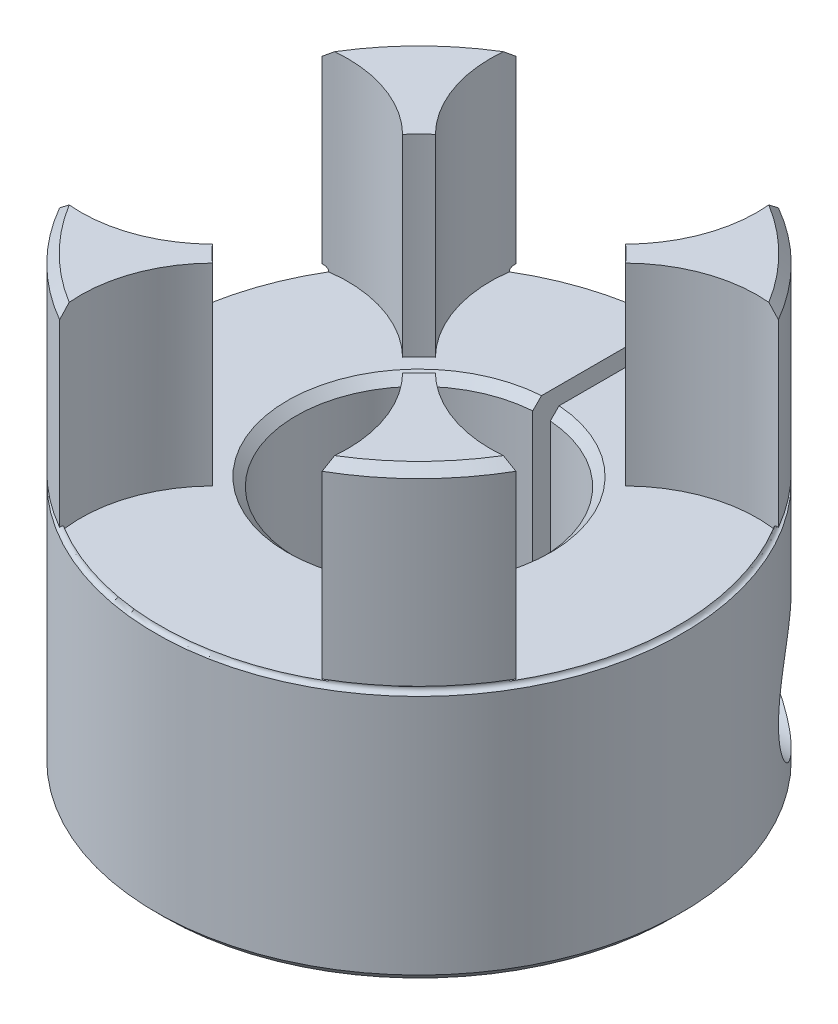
ISO-10303-21;
HEADER;
FILE_DESCRIPTION(('STEP AP214'),'2;1');
FILE_NAME('part.step','',(''),(''),'','','');
FILE_SCHEMA(('AUTOMOTIVE_DESIGN { 1 0 10303 214 1 1 1 1 }'));
ENDSEC;
DATA;
#1=APPLICATION_CONTEXT('core data for automotive mechanical design processes');
#2=APPLICATION_PROTOCOL_DEFINITION('international standard','automotive_design',2000,#1);
#3=PRODUCT_CONTEXT('',#1,'mechanical');
#4=PRODUCT('Part','Part','',(#3));
#5=PRODUCT_RELATED_PRODUCT_CATEGORY('part','',(#4));
#6=PRODUCT_DEFINITION_FORMATION('','',#4);
#7=PRODUCT_DEFINITION_CONTEXT('part definition',#1,'design');
#8=PRODUCT_DEFINITION('design','',#6,#7);
#9=PRODUCT_DEFINITION_SHAPE('','',#8);
#10=(LENGTH_UNIT() NAMED_UNIT(*) SI_UNIT(.MILLI.,.METRE.));
#11=(NAMED_UNIT(*) PLANE_ANGLE_UNIT() SI_UNIT($,.RADIAN.));
#12=(NAMED_UNIT(*) SI_UNIT($,.STERADIAN.) SOLID_ANGLE_UNIT());
#13=UNCERTAINTY_MEASURE_WITH_UNIT(LENGTH_MEASURE(1.E-05),#10,'distance_accuracy_value','');
#14=(GEOMETRIC_REPRESENTATION_CONTEXT(3) GLOBAL_UNCERTAINTY_ASSIGNED_CONTEXT((#13)) GLOBAL_UNIT_ASSIGNED_CONTEXT((#10,
#11,#12)) REPRESENTATION_CONTEXT('',''));
#15=CARTESIAN_POINT('',(0.,0.,0.));
#16=DIRECTION('',(0.,0.,1.));
#17=DIRECTION('',(1.,0.,0.));
#18=AXIS2_PLACEMENT_3D('',#15,#16,#17);
#19=CARTESIAN_POINT('',(0.,25.5,0.));
#20=DIRECTION('',(0.,-1.,0.));
#21=DIRECTION('',(0.,0.,-1.));
#22=AXIS2_PLACEMENT_3D('',#19,#20,#21);
#23=CYLINDRICAL_SURFACE('',#22,15.);
#24=CARTESIAN_POINT('',(0.,14.7498609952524,0.));
#25=DIRECTION('',(0.,-1.,0.));
#26=DIRECTION('',(0.,0.,-1.));
#27=AXIS2_PLACEMENT_3D('',#24,#25,#26);
#28=CIRCLE('',#27,15.);
#29=CARTESIAN_POINT('',(7.47962139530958,14.7498609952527,-13.00212535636));
#30=VERTEX_POINT('',#29);
#31=CARTESIAN_POINT('',(13.002125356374,14.7498609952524,-7.47962139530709));
#32=VERTEX_POINT('',#31);
#33=EDGE_CURVE('E701',#30,#32,#28,.T.);
#34=ORIENTED_EDGE('',*,*,#33,.F.);
#35=DIRECTION('',(0.,1.,0.));
#36=VECTOR('',#35,1.);
#37=CARTESIAN_POINT('',(7.47962139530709,14.5,-13.002125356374));
#38=LINE('',#37,#36);
#39=CARTESIAN_POINT('',(7.47962139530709,25.,-13.002125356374));
#40=VERTEX_POINT('',#39);
#41=EDGE_CURVE('E421',#30,#40,#38,.T.);
#42=ORIENTED_EDGE('',*,*,#41,.T.);
#43=CARTESIAN_POINT('',(0.,25.,0.));
#44=DIRECTION('',(0.,1.,0.));
#45=DIRECTION('',(0.,0.,1.));
#46=AXIS2_PLACEMENT_3D('',#43,#44,#45);
#47=CIRCLE('',#46,15.);
#48=CARTESIAN_POINT('',(13.002125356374,25.,-7.47962139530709));
#49=VERTEX_POINT('',#48);
#50=EDGE_CURVE('E601',#40,#49,#47,.F.);
#51=ORIENTED_EDGE('',*,*,#50,.T.);
#52=DIRECTION('',(0.,1.,0.));
#53=VECTOR('',#52,1.);
#54=CARTESIAN_POINT('',(13.002125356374,14.5,-7.47962139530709));
#55=LINE('',#54,#53);
#56=EDGE_CURVE('E423',#32,#49,#55,.T.);
#57=ORIENTED_EDGE('',*,*,#56,.F.);
#58=EDGE_LOOP('',(#34,#42,#51,#57));
#59=FACE_BOUND('',#58,.T.);
#60=ADVANCED_FACE('F131',(#59),#23,.T.);
#61=CARTESIAN_POINT('',(13.00212535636,14.7498609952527,7.47962139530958));
#62=VERTEX_POINT('',#61);
#63=CARTESIAN_POINT('',(7.47962139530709,14.7498609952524,13.002125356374));
#64=VERTEX_POINT('',#63);
#65=EDGE_CURVE('E645',#62,#64,#28,.T.);
#66=ORIENTED_EDGE('',*,*,#65,.F.);
#67=DIRECTION('',(0.,1.,0.));
#68=VECTOR('',#67,1.);
#69=CARTESIAN_POINT('',(13.002125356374,14.5,7.47962139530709));
#70=LINE('',#69,#68);
#71=CARTESIAN_POINT('',(13.002125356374,25.,7.47962139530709));
#72=VERTEX_POINT('',#71);
#73=EDGE_CURVE('E445',#62,#72,#70,.T.);
#74=ORIENTED_EDGE('',*,*,#73,.T.);
#75=CARTESIAN_POINT('',(0.,25.,0.));
#76=DIRECTION('',(0.,1.,0.));
#77=DIRECTION('',(0.,0.,1.));
#78=AXIS2_PLACEMENT_3D('',#75,#76,#77);
#79=CIRCLE('',#78,15.);
#80=CARTESIAN_POINT('',(7.47962139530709,25.,13.002125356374));
#81=VERTEX_POINT('',#80);
#82=EDGE_CURVE('E614',#72,#81,#79,.F.);
#83=ORIENTED_EDGE('',*,*,#82,.T.);
#84=DIRECTION('',(0.,1.,0.));
#85=VECTOR('',#84,1.);
#86=CARTESIAN_POINT('',(7.47962139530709,14.5,13.002125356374));
#87=LINE('',#86,#85);
#88=EDGE_CURVE('E447',#64,#81,#87,.T.);
#89=ORIENTED_EDGE('',*,*,#88,.F.);
#90=EDGE_LOOP('',(#66,#74,#83,#89));
#91=FACE_BOUND('',#90,.T.);
#92=ADVANCED_FACE('F777',(#91),#23,.T.);
#93=CARTESIAN_POINT('',(-7.47962139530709,14.7498609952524,13.002125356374));
#94=VERTEX_POINT('',#93);
#95=CARTESIAN_POINT('',(-13.002125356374,14.7498609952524,7.47962139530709));
#96=VERTEX_POINT('',#95);
#97=EDGE_CURVE('E705',#94,#96,#28,.T.);
#98=ORIENTED_EDGE('',*,*,#97,.F.);
#99=DIRECTION('',(0.,1.,0.));
#100=VECTOR('',#99,1.);
#101=CARTESIAN_POINT('',(-7.47962139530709,14.5,13.002125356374));
#102=LINE('',#101,#100);
#103=CARTESIAN_POINT('',(-7.47962139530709,25.,13.002125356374));
#104=VERTEX_POINT('',#103);
#105=EDGE_CURVE('E469',#94,#104,#102,.T.);
#106=ORIENTED_EDGE('',*,*,#105,.T.);
#107=CARTESIAN_POINT('',(0.,25.,0.));
#108=DIRECTION('',(0.,1.,0.));
#109=DIRECTION('',(0.,0.,1.));
#110=AXIS2_PLACEMENT_3D('',#107,#108,#109);
#111=CIRCLE('',#110,15.);
#112=CARTESIAN_POINT('',(-13.002125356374,25.,7.47962139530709));
#113=VERTEX_POINT('',#112);
#114=EDGE_CURVE('E611',#104,#113,#111,.F.);
#115=ORIENTED_EDGE('',*,*,#114,.T.);
#116=DIRECTION('',(0.,1.,0.));
#117=VECTOR('',#116,1.);
#118=CARTESIAN_POINT('',(-13.002125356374,14.5,7.47962139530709));
#119=LINE('',#118,#117);
#120=EDGE_CURVE('E471',#96,#113,#119,.T.);
#121=ORIENTED_EDGE('',*,*,#120,.F.);
#122=EDGE_LOOP('',(#98,#106,#115,#121));
#123=FACE_BOUND('',#122,.T.);
#124=ADVANCED_FACE('F782',(#123),#23,.T.);
#125=CARTESIAN_POINT('',(-13.002125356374,14.7498609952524,-7.47962139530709));
#126=VERTEX_POINT('',#125);
#127=CARTESIAN_POINT('',(-7.47962139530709,14.7498609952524,-13.002125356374));
#128=VERTEX_POINT('',#127);
#129=EDGE_CURVE('E696',#126,#128,#28,.T.);
#130=ORIENTED_EDGE('',*,*,#129,.F.);
#131=DIRECTION('',(0.,1.,0.));
#132=VECTOR('',#131,1.);
#133=CARTESIAN_POINT('',(-13.002125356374,14.5,-7.47962139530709));
#134=LINE('',#133,#132);
#135=CARTESIAN_POINT('',(-13.002125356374,25.,-7.47962139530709));
#136=VERTEX_POINT('',#135);
#137=EDGE_CURVE('E493',#126,#136,#134,.T.);
#138=ORIENTED_EDGE('',*,*,#137,.T.);
#139=CARTESIAN_POINT('',(0.,25.,0.));
#140=DIRECTION('',(0.,1.,0.));
#141=DIRECTION('',(0.,0.,1.));
#142=AXIS2_PLACEMENT_3D('',#139,#140,#141);
#143=CIRCLE('',#142,15.);
#144=CARTESIAN_POINT('',(-7.47962139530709,25.,-13.002125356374));
#145=VERTEX_POINT('',#144);
#146=EDGE_CURVE('E597',#136,#145,#143,.F.);
#147=ORIENTED_EDGE('',*,*,#146,.T.);
#148=DIRECTION('',(0.,1.,0.));
#149=VECTOR('',#148,1.);
#150=CARTESIAN_POINT('',(-7.47962139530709,14.5,-13.002125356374));
#151=LINE('',#150,#149);
#152=EDGE_CURVE('E495',#128,#145,#151,.T.);
#153=ORIENTED_EDGE('',*,*,#152,.F.);
#154=EDGE_LOOP('',(#130,#138,#147,#153));
#155=FACE_BOUND('',#154,.T.);
#156=ADVANCED_FACE('F734',(#155),#23,.T.);
#157=CARTESIAN_POINT('',(4.5,7.83938793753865,-14.3090880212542));
#158=CARTESIAN_POINT('',(4.65317503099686,7.88719721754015,-14.2609127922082));
#159=CARTESIAN_POINT('',(4.80557223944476,7.93499058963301,-14.2102871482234));
#160=CARTESIAN_POINT('',(5.10886261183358,8.02989978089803,-14.1040904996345));
#161=CARTESIAN_POINT('',(5.25975564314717,8.07701554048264,-14.0485190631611));
#162=CARTESIAN_POINT('',(5.71079872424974,8.21654529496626,-13.8741071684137));
#163=CARTESIAN_POINT('',(6.00871846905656,8.30695112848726,-13.7477557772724));
#164=CARTESIAN_POINT('',(6.60150945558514,8.47849293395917,-13.4732318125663));
#165=CARTESIAN_POINT('',(6.89630761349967,8.55951192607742,-13.3248276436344));
#166=CARTESIAN_POINT('',(7.47822661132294,8.70592584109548,-13.007144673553));
#167=CARTESIAN_POINT('',(7.76535472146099,8.77133606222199,-12.8378865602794));
#168=CARTESIAN_POINT('',(8.21954173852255,8.85937568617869,-12.5491244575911));
#169=CARTESIAN_POINT('',(8.38948855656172,8.88871926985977,-12.4361714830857));
#170=CARTESIAN_POINT('',(8.72551790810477,8.93809398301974,-12.2027520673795));
#171=CARTESIAN_POINT('',(8.89160131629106,8.958127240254,-12.0822873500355));
#172=CARTESIAN_POINT('',(9.21885498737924,8.98723036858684,-11.8344718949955));
#173=CARTESIAN_POINT('',(9.3800373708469,8.99632987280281,-11.7071407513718));
#174=CARTESIAN_POINT('',(9.69716370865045,9.00187111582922,-11.4458374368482));
#175=CARTESIAN_POINT('',(9.85310870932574,8.99831539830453,-11.3118666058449));
#176=CARTESIAN_POINT('',(10.131318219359,8.97853212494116,-11.0627626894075));
#177=CARTESIAN_POINT('',(10.2545969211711,8.96469801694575,-10.9485738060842));
#178=CARTESIAN_POINT('',(10.4963441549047,8.92603100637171,-10.71703129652));
#179=CARTESIAN_POINT('',(10.6148138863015,8.90120086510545,-10.5996784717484));
#180=CARTESIAN_POINT('',(10.8461711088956,8.83935622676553,-10.3628147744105));
#181=CARTESIAN_POINT('',(10.9590627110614,8.80235086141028,-10.2433055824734));
#182=CARTESIAN_POINT('',(11.178474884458,8.71502502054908,-10.003408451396));
#183=CARTESIAN_POINT('',(11.2849973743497,8.66470857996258,-9.88302078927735));
#184=CARTESIAN_POINT('',(11.5430048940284,8.5204308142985,-9.58203704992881));
#185=CARTESIAN_POINT('',(11.690001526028,8.41726405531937,-9.401765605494));
#186=CARTESIAN_POINT('',(11.8956481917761,8.23612058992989,-9.13816972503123));
#187=CARTESIAN_POINT('',(11.961746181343,8.17130886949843,-9.0514058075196));
#188=CARTESIAN_POINT('',(12.0886363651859,8.03275504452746,-8.88122086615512));
#189=CARTESIAN_POINT('',(12.1494312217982,7.95901746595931,-8.79779817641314));
#190=CARTESIAN_POINT('',(12.2658913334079,7.8019105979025,-8.63470094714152));
#191=CARTESIAN_POINT('',(12.3215032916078,7.71845767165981,-8.55506876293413));
#192=CARTESIAN_POINT('',(12.4265803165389,7.54278742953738,-8.40171034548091));
#193=CARTESIAN_POINT('',(12.4760485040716,7.45057460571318,-8.32798112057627));
#194=CARTESIAN_POINT('',(12.5685596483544,7.25787393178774,-8.18769635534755));
#195=CARTESIAN_POINT('',(12.6116044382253,7.15738845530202,-8.12113876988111));
#196=CARTESIAN_POINT('',(12.6910455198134,6.94886169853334,-7.9964263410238));
#197=CARTESIAN_POINT('',(12.7274430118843,6.8408217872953,-7.93826998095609));
#198=CARTESIAN_POINT('',(12.7887559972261,6.63389657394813,-7.83904494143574));
#199=CARTESIAN_POINT('',(12.8145671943,6.53587478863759,-7.79672290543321));
#200=CARTESIAN_POINT('',(12.8610885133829,6.33570231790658,-7.71974267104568));
#201=CARTESIAN_POINT('',(12.8817992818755,6.23355215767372,-7.68508350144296));
#202=CARTESIAN_POINT('',(12.9180630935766,6.02598126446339,-7.62396942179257));
#203=CARTESIAN_POINT('',(12.9336182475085,5.92056188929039,-7.59751115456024));
#204=CARTESIAN_POINT('',(12.9595513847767,5.70730681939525,-7.55319069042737));
#205=CARTESIAN_POINT('',(12.9699296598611,5.59947126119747,-7.53532800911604));
#206=CARTESIAN_POINT('',(12.9847893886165,5.39215247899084,-7.50968982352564));
#207=CARTESIAN_POINT('',(12.9897189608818,5.29279506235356,-7.50114865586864));
#208=CARTESIAN_POINT('',(12.9952773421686,5.09356496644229,-7.49151512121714));
#209=CARTESIAN_POINT('',(12.9959047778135,4.99369213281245,-7.49042513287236));
#210=CARTESIAN_POINT('',(12.9928549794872,4.79427210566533,-7.49571400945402));
#211=CARTESIAN_POINT('',(12.989180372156,4.69472475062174,-7.50208831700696));
#212=CARTESIAN_POINT('',(12.9775334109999,4.49659729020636,-7.52221783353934));
#213=CARTESIAN_POINT('',(12.9695594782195,4.39801755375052,-7.53597575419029));
#214=CARTESIAN_POINT('',(12.9495481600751,4.20477292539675,-7.57030967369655));
#215=CARTESIAN_POINT('',(12.937605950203,4.1100698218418,-7.59072578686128));
#216=CARTESIAN_POINT('',(12.9096417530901,3.92294400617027,-7.63818704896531));
#217=CARTESIAN_POINT('',(12.8936183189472,3.83052211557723,-7.66523454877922));
#218=CARTESIAN_POINT('',(12.8394654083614,3.55768781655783,-7.75584479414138));
#219=CARTESIAN_POINT('',(12.7952327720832,3.38150627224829,-7.82891163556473));
#220=CARTESIAN_POINT('',(12.68969994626,3.04107016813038,-7.99885531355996));
#221=CARTESIAN_POINT('',(12.6280165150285,2.87720210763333,-8.09626027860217));
#222=CARTESIAN_POINT('',(12.4888128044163,2.56934253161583,-8.30937549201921));
#223=CARTESIAN_POINT('',(12.4112893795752,2.42535497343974,-8.42508937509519));
#224=CARTESIAN_POINT('',(12.2350588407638,2.14901993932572,-8.67922706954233));
#225=CARTESIAN_POINT('',(12.135186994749,2.01839789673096,-8.8187098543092));
#226=CARTESIAN_POINT('',(11.9201220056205,1.78292442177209,-9.10730779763));
#227=CARTESIAN_POINT('',(11.8049193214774,1.67808915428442,-9.25642892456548));
#228=CARTESIAN_POINT('',(11.5958242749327,1.51957778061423,-9.51610841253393));
#229=CARTESIAN_POINT('',(11.5051385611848,1.45982183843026,-9.62562558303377));
#230=CARTESIAN_POINT('',(11.3176305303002,1.35242508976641,-9.84540959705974));
#231=CARTESIAN_POINT('',(11.2208061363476,1.30478841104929,-9.95567668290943));
#232=CARTESIAN_POINT('',(11.0216789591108,1.22083515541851,-10.1756883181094));
#233=CARTESIAN_POINT('',(10.9193721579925,1.18452701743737,-10.2854324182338));
#234=CARTESIAN_POINT('',(10.7099599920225,1.12237152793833,-10.5033143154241));
#235=CARTESIAN_POINT('',(10.6028531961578,1.09652731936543,-10.6114516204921));
#236=CARTESIAN_POINT('',(10.3387140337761,1.04557271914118,-10.8700478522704));
#237=CARTESIAN_POINT('',(10.1795428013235,1.02529362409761,-11.0192837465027));
#238=CARTESIAN_POINT('',(9.85412308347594,1.0013856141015,-11.3112386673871));
#239=CARTESIAN_POINT('',(9.68787141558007,0.997764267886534,-11.4539547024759));
#240=CARTESIAN_POINT('',(9.34857650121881,1.00481595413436,-11.7325424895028));
#241=CARTESIAN_POINT('',(9.17550167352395,1.0155655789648,-11.8683735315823));
#242=CARTESIAN_POINT('',(8.82430532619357,1.04931721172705,-12.1317712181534));
#243=CARTESIAN_POINT('',(8.64618202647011,1.07232359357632,-12.2593348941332));
#244=CARTESIAN_POINT('',(8.15213996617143,1.14948469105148,-12.5971014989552));
#245=CARTESIAN_POINT('',(7.83183720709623,1.21408985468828,-12.7985662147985));
#246=CARTESIAN_POINT('',(7.18072000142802,1.36574661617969,-13.1749419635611));
#247=CARTESIAN_POINT('',(6.84988958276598,1.45283390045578,-13.3498100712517));
#248=CARTESIAN_POINT('',(6.18623368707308,1.64003819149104,-13.6698039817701));
#249=CARTESIAN_POINT('',(5.85357404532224,1.73986675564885,-13.8154450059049));
#250=CARTESIAN_POINT('',(5.34952932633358,1.89504065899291,-14.0148152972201));
#251=CARTESIAN_POINT('',(5.18094366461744,1.94758272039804,-14.0780048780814));
#252=CARTESIAN_POINT('',(4.84189634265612,2.05361200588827,-14.1981808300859));
#253=CARTESIAN_POINT('',(4.6714349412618,2.10709910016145,-14.2551680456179));
#254=CARTESIAN_POINT('',(4.5,2.16061206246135,-14.3090880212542));
#255=B_SPLINE_CURVE_WITH_KNOTS('',3,(#157,#158,#159,#160,#161,#162,#163,#164,#165,#166,#167,
#168,#169,#170,#171,#172,#173,#174,#175,#176,#177,#178,#179,#180,#181,#182,#183,#184,#185,#186,
#187,#188,#189,#190,#191,#192,#193,#194,#195,#196,#197,#198,#199,#200,#201,#202,#203,#204,#205,
#206,#207,#208,#209,#210,#211,#212,#213,#214,#215,#216,#217,#218,#219,#220,#221,#222,#223,#224,
#225,#226,#227,#228,#229,#230,#231,#232,#233,#234,#235,#236,#237,#238,#239,#240,#241,#242,#243,
#244,#245,#246,#247,#248,#249,#250,#251,#252,#253,#254),.UNSPECIFIED.,.F.,.F.,(4,2,2,2,2,2,2,2,
2,2,2,2,2,2,2,2,2,2,2,2,2,2,2,2,2,2,2,2,2,2,2,2,2,2,2,2,2,2,2,2,2,2,2,2,2,2,2,2,4),(0.,
0.502572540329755,1.00518900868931,2.01237277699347,3.03099880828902,4.048622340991,
4.66677674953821,5.28478981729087,5.90112411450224,6.51733453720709,7.02274582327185,
7.52803026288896,8.03293658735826,8.53769003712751,9.29757417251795,9.67782510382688,
10.0578840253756,10.4414977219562,10.8249157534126,11.2082241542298,11.5914632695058,
11.9205512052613,12.2495974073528,12.5785087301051,12.9074015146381,13.2065739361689,
13.5058418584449,13.8049271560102,14.1041223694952,14.3966052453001,14.6891919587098,
15.2737584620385,15.8723193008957,16.4709991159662,17.1153411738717,17.7600861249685,
18.222206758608,18.6844845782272,19.1471059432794,19.6098661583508,20.2662456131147,
20.9229232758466,21.5831147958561,22.243542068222,23.3929180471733,24.5441297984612,
25.6728054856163,26.235358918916,26.7978356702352),.UNSPECIFIED.);
#256=CARTESIAN_POINT('',(4.5,7.83938793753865,-14.3090880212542));
#257=VERTEX_POINT('',#256);
#258=CARTESIAN_POINT('',(4.5,2.16061206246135,-14.3090880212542));
#259=VERTEX_POINT('',#258);
#260=EDGE_CURVE('E511',#257,#259,#255,.T.);
#261=ORIENTED_EDGE('',*,*,#260,.F.);
#262=DIRECTION('',(0.,-1.,0.));
#263=VECTOR('',#262,1.);
#264=CARTESIAN_POINT('',(4.5,25.5,-14.3090880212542));
#265=LINE('',#264,#263);
#266=EDGE_CURVE('E509',#259,#257,#265,.F.);
#267=ORIENTED_EDGE('',*,*,#266,.F.);
#268=EDGE_LOOP('',(#261,#267));
#269=FACE_BOUND('',#268,.T.);
#270=CARTESIAN_POINT('',(-7.23164283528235,5.,-13.1416643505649));
#271=CARTESIAN_POINT('',(-7.23165321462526,5.0485708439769,-13.1416590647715));
#272=CARTESIAN_POINT('',(-7.23559288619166,5.09721977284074,-13.1394930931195));
#273=CARTESIAN_POINT('',(-7.25090857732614,5.19302418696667,-13.1310469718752));
#274=CARTESIAN_POINT('',(-7.26230699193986,5.24017472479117,-13.1247544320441));
#275=CARTESIAN_POINT('',(-7.29511659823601,5.34359124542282,-13.1065519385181));
#276=CARTESIAN_POINT('',(-7.31834648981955,5.39909193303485,-13.0936149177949));
#277=CARTESIAN_POINT('',(-7.37210422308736,5.50510207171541,-13.0634234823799));
#278=CARTESIAN_POINT('',(-7.40264439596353,5.55560288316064,-13.0461617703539));
#279=CARTESIAN_POINT('',(-7.48960060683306,5.68188907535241,-12.9965257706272));
#280=CARTESIAN_POINT('',(-7.55023377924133,5.75367208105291,-12.9614624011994));
#281=CARTESIAN_POINT('',(-7.6791953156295,5.88636150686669,-12.8854811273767));
#282=CARTESIAN_POINT('',(-7.74754584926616,5.94723522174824,-12.8445462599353));
#283=CARTESIAN_POINT('',(-7.88264899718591,6.05490892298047,-12.7620360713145));
#284=CARTESIAN_POINT('',(-7.9490247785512,6.10247206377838,-12.7208251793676));
#285=CARTESIAN_POINT('',(-8.08424065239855,6.19093452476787,-12.6353259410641));
#286=CARTESIAN_POINT('',(-8.15308264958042,6.23182855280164,-12.5910351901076));
#287=CARTESIAN_POINT('',(-8.29235924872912,6.30758717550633,-12.4997487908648));
#288=CARTESIAN_POINT('',(-8.36279523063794,6.34244630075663,-12.4527507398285));
#289=CARTESIAN_POINT('',(-8.50459792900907,6.40647862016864,-12.3563413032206));
#290=CARTESIAN_POINT('',(-8.57596479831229,6.43565086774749,-12.306929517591));
#291=CARTESIAN_POINT('',(-8.7247550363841,6.4905611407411,-12.2019492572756));
#292=CARTESIAN_POINT('',(-8.80221661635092,6.51585381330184,-12.146201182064));
#293=CARTESIAN_POINT('',(-8.95721166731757,6.56008912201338,-12.0323576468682));
#294=CARTESIAN_POINT('',(-9.03474514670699,6.5790308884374,-11.9742618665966));
#295=CARTESIAN_POINT('',(-9.266748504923,6.62615112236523,-11.7968263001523));
#296=CARTESIAN_POINT('',(-9.42082972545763,6.64470101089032,-11.6741917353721));
#297=CARTESIAN_POINT('',(-9.70955614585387,6.65292615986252,-11.4348690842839));
#298=CARTESIAN_POINT('',(-9.84462411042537,6.64525805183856,-11.3187796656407));
#299=CARTESIAN_POINT('',(-10.1083010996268,6.6032593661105,-11.0839160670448));
#300=CARTESIAN_POINT('',(-10.2369182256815,6.56896317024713,-10.965145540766));
#301=CARTESIAN_POINT('',(-10.4471917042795,6.48378503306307,-10.7643281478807));
#302=CARTESIAN_POINT('',(-10.5315266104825,6.44075750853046,-10.6817630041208));
#303=CARTESIAN_POINT('',(-10.6927776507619,6.3372297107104,-10.5203337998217));
#304=CARTESIAN_POINT('',(-10.7697042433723,6.27675456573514,-10.4414646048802));
#305=CARTESIAN_POINT('',(-10.8964011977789,6.15321433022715,-10.3089675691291));
#306=CARTESIAN_POINT('',(-10.94831430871,6.09406532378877,-10.2537513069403));
#307=CARTESIAN_POINT('',(-11.0443187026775,5.96437447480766,-10.1502701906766));
#308=CARTESIAN_POINT('',(-11.0884195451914,5.89384676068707,-10.1019968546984));
#309=CARTESIAN_POINT('',(-11.1597625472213,5.75557960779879,-10.0230744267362));
#310=CARTESIAN_POINT('',(-11.188608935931,5.68959177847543,-9.99081746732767));
#311=CARTESIAN_POINT('',(-11.2384540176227,5.55132831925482,-9.9347150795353));
#312=CARTESIAN_POINT('',(-11.2594562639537,5.47905555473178,-9.91086584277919));
#313=CARTESIAN_POINT('',(-11.2926275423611,5.32951617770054,-9.87305480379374));
#314=CARTESIAN_POINT('',(-11.304744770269,5.25222309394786,-9.85915099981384));
#315=CARTESIAN_POINT('',(-11.3191992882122,5.09554375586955,-9.84255337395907));
#316=CARTESIAN_POINT('',(-11.3215407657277,5.01615841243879,-9.83985475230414));
#317=CARTESIAN_POINT('',(-11.3165721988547,4.86606251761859,-9.84556736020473));
#318=CARTESIAN_POINT('',(-11.3101998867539,4.79527521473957,-9.85289920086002));
#319=CARTESIAN_POINT('',(-11.2897588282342,4.65633223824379,-9.8763143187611));
#320=CARTESIAN_POINT('',(-11.2756905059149,4.58817641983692,-9.89239711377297));
#321=CARTESIAN_POINT('',(-11.2403441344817,4.45549129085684,-9.93254132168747));
#322=CARTESIAN_POINT('',(-11.2189972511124,4.39100372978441,-9.95667886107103));
#323=CARTESIAN_POINT('',(-11.1700022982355,4.2675210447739,-10.0116134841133));
#324=CARTESIAN_POINT('',(-11.1423512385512,4.20852854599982,-10.0424137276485));
#325=CARTESIAN_POINT('',(-11.0698431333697,4.07494287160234,-10.1223751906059));
#326=CARTESIAN_POINT('',(-11.0224750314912,4.0031929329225,-10.1740208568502));
#327=CARTESIAN_POINT('',(-10.9195924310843,3.87202966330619,-10.2843680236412));
#328=CARTESIAN_POINT('',(-10.8640629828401,3.81263946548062,-10.3430824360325));
#329=CARTESIAN_POINT('',(-10.725883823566,3.68684615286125,-10.4865852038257));
#330=CARTESIAN_POINT('',(-10.6406093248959,3.62545181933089,-10.5732242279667));
#331=CARTESIAN_POINT('',(-10.4620874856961,3.52257257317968,-10.7499131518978));
#332=CARTESIAN_POINT('',(-10.3688275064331,3.4811199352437,-10.8399683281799));
#333=CARTESIAN_POINT('',(-10.1370737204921,3.40230025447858,-11.0577684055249));
#334=CARTESIAN_POINT('',(-9.99580574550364,3.3736912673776,-11.1857183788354));
#335=CARTESIAN_POINT('',(-9.7068988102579,3.34603192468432,-11.4373546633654));
#336=CARTESIAN_POINT('',(-9.55925116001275,3.34702324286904,-11.5610347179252));
#337=CARTESIAN_POINT('',(-9.25595687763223,3.37528203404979,-11.8053509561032));
#338=CARTESIAN_POINT('',(-9.10020590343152,3.40339694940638,-11.9257598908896));
#339=CARTESIAN_POINT('',(-8.86659708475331,3.46473544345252,-12.0992949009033));
#340=CARTESIAN_POINT('',(-8.78871192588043,3.48838385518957,-12.1559727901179));
#341=CARTESIAN_POINT('',(-8.63334752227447,3.54210441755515,-12.2668002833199));
#342=CARTESIAN_POINT('',(-8.55586819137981,3.57217514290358,-12.3209504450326));
#343=CARTESIAN_POINT('',(-8.42003820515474,3.63105058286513,-12.4140264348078));
#344=CARTESIAN_POINT('',(-8.36148487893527,3.6584819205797,-12.4535313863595));
#345=CARTESIAN_POINT('',(-8.24526285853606,3.7173879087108,-12.5307822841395));
#346=CARTESIAN_POINT('',(-8.1875940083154,3.74886183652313,-12.5685285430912));
#347=CARTESIAN_POINT('',(-8.07362319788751,3.81610256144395,-12.6420409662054));
#348=CARTESIAN_POINT('',(-8.01731961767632,3.85186393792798,-12.6778095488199));
#349=CARTESIAN_POINT('',(-7.90661941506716,3.92811861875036,-12.7471420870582));
#350=CARTESIAN_POINT('',(-7.85222185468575,3.96860955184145,-12.7807071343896));
#351=CARTESIAN_POINT('',(-7.73859375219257,4.06107815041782,-12.8498711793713));
#352=CARTESIAN_POINT('',(-7.67977874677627,4.11387045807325,-12.8850786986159));
#353=CARTESIAN_POINT('',(-7.56776063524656,4.22758813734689,-12.9511854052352));
#354=CARTESIAN_POINT('',(-7.5145514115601,4.28850447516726,-12.9820893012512));
#355=CARTESIAN_POINT('',(-7.43092565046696,4.40133176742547,-13.0300800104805));
#356=CARTESIAN_POINT('',(-7.39830391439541,4.45096999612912,-13.0486101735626));
#357=CARTESIAN_POINT('',(-7.33985421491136,4.55541025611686,-13.0815772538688));
#358=CARTESIAN_POINT('',(-7.31401653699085,4.61020474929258,-13.0960200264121));
#359=CARTESIAN_POINT('',(-7.27649169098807,4.71162154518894,-13.1168984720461));
#360=CARTESIAN_POINT('',(-7.26293081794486,4.75732236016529,-13.1244033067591));
#361=CARTESIAN_POINT('',(-7.24274482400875,4.85062783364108,-13.1355543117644));
#362=CARTESIAN_POINT('',(-7.23609795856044,4.89822603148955,-13.1392125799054));
#363=CARTESIAN_POINT('',(-7.23217486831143,4.96400799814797,-13.1413714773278));
#364=CARTESIAN_POINT('',(-7.23163898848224,4.98199863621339,-13.1416663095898));
#365=CARTESIAN_POINT('',(-7.23164283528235,5.,-13.1416643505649));
#366=B_SPLINE_CURVE_WITH_KNOTS('',3,(#270,#271,#272,#273,#274,#275,#276,#277,#278,#279,#280,
#281,#282,#283,#284,#285,#286,#287,#288,#289,#290,#291,#292,#293,#294,#295,#296,#297,#298,#299,
#300,#301,#302,#303,#304,#305,#306,#307,#308,#309,#310,#311,#312,#313,#314,#315,#316,#317,#318,
#319,#320,#321,#322,#323,#324,#325,#326,#327,#328,#329,#330,#331,#332,#333,#334,#335,#336,#337,
#338,#339,#340,#341,#342,#343,#344,#345,#346,#347,#348,#349,#350,#351,#352,#353,#354,#355,#356,
#357,#358,#359,#360,#361,#362,#363,#364,#365),.UNSPECIFIED.,.T.,.F.,(4,2,2,2,2,2,2,2,2,2,2,2,2,
2,2,2,2,2,2,2,2,2,2,2,2,2,2,2,2,2,2,2,2,2,2,2,2,2,2,2,2,2,2,2,2,2,2,4),(0.,0.145652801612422,
0.291744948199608,0.475322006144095,0.659210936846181,0.958410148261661,1.25849185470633,
1.53251002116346,1.80674458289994,2.08122639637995,2.35575385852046,2.65169444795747,
2.94767554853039,3.53884608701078,4.0719631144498,4.60439293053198,4.98008879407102,
5.3552462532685,5.6426331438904,5.92966590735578,6.16543583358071,6.40109882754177,
6.6381251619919,6.8750499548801,7.08838558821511,7.30170946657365,7.51710946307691,
7.73261184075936,8.03183852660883,8.33162032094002,8.73794154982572,9.14491819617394,
9.71997800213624,10.2958474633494,10.8903121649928,11.1876857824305,11.4849934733,
11.7121978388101,11.9393616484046,12.1662412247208,12.3930075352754,12.6520800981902,
12.9108669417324,13.0970042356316,13.2828735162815,13.4270775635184,13.5708267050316,
13.6248086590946),.UNSPECIFIED.);
#367=CARTESIAN_POINT('',(-7.23164283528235,5.,-13.1416643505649));
#368=VERTEX_POINT('',#367);
#369=EDGE_CURVE('E520',#368,#368,#366,.T.);
#370=ORIENTED_EDGE('',*,*,#369,.T.);
#371=EDGE_LOOP('',(#370));
#372=FACE_BOUND('',#371,.T.);
#373=CARTESIAN_POINT('',(0.,14.2501390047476,0.));
#374=DIRECTION('',(0.,1.,0.));
#375=DIRECTION('',(0.,0.,1.));
#376=AXIS2_PLACEMENT_3D('',#373,#374,#375);
#377=CIRCLE('',#376,15.);
#378=CARTESIAN_POINT('',(-0.5,14.2501390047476,-14.9916643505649));
#379=VERTEX_POINT('',#378);
#380=CARTESIAN_POINT('',(0.5,14.2501390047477,-14.9916643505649));
#381=VERTEX_POINT('',#380);
#382=EDGE_CURVE('E150',#379,#381,#377,.T.);
#383=ORIENTED_EDGE('',*,*,#382,.F.);
#384=DIRECTION('',(0.,-1.,0.));
#385=VECTOR('',#384,1.);
#386=CARTESIAN_POINT('',(-0.5,25.5,-14.9916643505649));
#387=LINE('',#386,#385);
#388=CARTESIAN_POINT('',(-0.5,0.499999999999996,-14.9916643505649));
#389=VERTEX_POINT('',#388);
#390=EDGE_CURVE('E395',#389,#379,#387,.F.);
#391=ORIENTED_EDGE('',*,*,#390,.F.);
#392=CARTESIAN_POINT('',(0.,0.499999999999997,0.));
#393=DIRECTION('',(0.,1.,0.));
#394=DIRECTION('',(0.,0.,1.));
#395=AXIS2_PLACEMENT_3D('',#392,#393,#394);
#396=CIRCLE('',#395,15.);
#397=CARTESIAN_POINT('',(0.5,0.499999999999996,-14.9916643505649));
#398=VERTEX_POINT('',#397);
#399=EDGE_CURVE('E596',#389,#398,#396,.T.);
#400=ORIENTED_EDGE('',*,*,#399,.T.);
#401=DIRECTION('',(0.,-1.,0.));
#402=VECTOR('',#401,1.);
#403=CARTESIAN_POINT('',(0.5,25.5,-14.9916643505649));
#404=LINE('',#403,#402);
#405=EDGE_CURVE('E398',#398,#381,#404,.F.);
#406=ORIENTED_EDGE('',*,*,#405,.T.);
#407=EDGE_LOOP('',(#383,#391,#400,#406));
#408=FACE_BOUND('',#407,.T.);
#409=ADVANCED_FACE('F595',(#269,#372,#408),#23,.T.);
#410=CARTESIAN_POINT('',(0.,14.5,0.));
#411=DIRECTION('',(0.,1.,0.));
#412=DIRECTION('',(0.,0.,1.));
#413=AXIS2_PLACEMENT_3D('',#410,#411,#412);
#414=PLANE('',#413);
#415=DIRECTION('',(0.,0.,1.));
#416=VECTOR('',#415,1.);
#417=CARTESIAN_POINT('',(-0.5,14.5,-4.11111111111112));
#418=LINE('',#417,#416);
#419=CARTESIAN_POINT('',(-0.5,14.4999999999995,-14.7331825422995));
#420=VERTEX_POINT('',#419);
#421=CARTESIAN_POINT('',(-0.5,14.5,-7.48331477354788));
#422=VERTEX_POINT('',#421);
#423=EDGE_CURVE('E718',#420,#422,#418,.T.);
#424=ORIENTED_EDGE('',*,*,#423,.F.);
#425=CARTESIAN_POINT('',(0.,14.5,0.));
#426=DIRECTION('',(0.,-1.,0.));
#427=DIRECTION('',(0.,0.,-1.));
#428=AXIS2_PLACEMENT_3D('',#425,#426,#427);
#429=CIRCLE('',#428,14.7416643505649);
#430=CARTESIAN_POINT('',(-7.53059391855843,14.5,-12.6730747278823));
#431=VERTEX_POINT('',#430);
#432=EDGE_CURVE('E378',#420,#431,#429,.F.);
#433=ORIENTED_EDGE('',*,*,#432,.T.);
#434=CARTESIAN_POINT('',(0.,14.5,-11.675));
#435=DIRECTION('',(0.,1.,0.));
#436=DIRECTION('',(0.,0.,1.));
#437=AXIS2_PLACEMENT_3D('',#434,#435,#436);
#438=CIRCLE('',#437,7.59644640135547);
#439=CARTESIAN_POINT('',(-5.41968665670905,14.5,-6.35212535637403));
#440=VERTEX_POINT('',#439);
#441=EDGE_CURVE('E477',#431,#440,#438,.T.);
#442=ORIENTED_EDGE('',*,*,#441,.T.);
#443=CARTESIAN_POINT('',(0.,14.5,0.));
#444=DIRECTION('',(0.,1.,0.));
#445=DIRECTION('',(0.,0.,1.));
#446=AXIS2_PLACEMENT_3D('',#443,#444,#445);
#447=CIRCLE('',#446,8.35);
#448=CARTESIAN_POINT('',(-6.35212535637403,14.5,-5.41968665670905));
#449=VERTEX_POINT('',#448);
#450=EDGE_CURVE('E475',#440,#449,#447,.T.);
#451=ORIENTED_EDGE('',*,*,#450,.T.);
#452=CARTESIAN_POINT('',(-11.675,14.5,0.));
#453=DIRECTION('',(0.,1.,0.));
#454=DIRECTION('',(0.,0.,1.));
#455=AXIS2_PLACEMENT_3D('',#452,#453,#454);
#456=CIRCLE('',#455,7.59644640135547);
#457=CARTESIAN_POINT('',(-12.6730747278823,14.5,-7.53059391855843));
#458=VERTEX_POINT('',#457);
#459=EDGE_CURVE('E480',#449,#458,#456,.T.);
#460=ORIENTED_EDGE('',*,*,#459,.T.);
#461=CARTESIAN_POINT('',(-12.6730747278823,14.5,7.53059391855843));
#462=VERTEX_POINT('',#461);
#463=EDGE_CURVE('E699',#458,#462,#429,.F.);
#464=ORIENTED_EDGE('',*,*,#463,.T.);
#465=CARTESIAN_POINT('',(-11.675,14.5,0.));
#466=DIRECTION('',(0.,1.,0.));
#467=DIRECTION('',(0.,0.,1.));
#468=AXIS2_PLACEMENT_3D('',#465,#466,#467);
#469=CIRCLE('',#468,7.59644640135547);
#470=CARTESIAN_POINT('',(-6.35212535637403,14.5,5.41968665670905));
#471=VERTEX_POINT('',#470);
#472=EDGE_CURVE('E453',#462,#471,#469,.T.);
#473=ORIENTED_EDGE('',*,*,#472,.T.);
#474=CARTESIAN_POINT('',(0.,14.5,0.));
#475=DIRECTION('',(0.,1.,0.));
#476=DIRECTION('',(0.,0.,1.));
#477=AXIS2_PLACEMENT_3D('',#474,#475,#476);
#478=CIRCLE('',#477,8.35);
#479=CARTESIAN_POINT('',(-5.41968665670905,14.5,6.35212535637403));
#480=VERTEX_POINT('',#479);
#481=EDGE_CURVE('E451',#471,#480,#478,.T.);
#482=ORIENTED_EDGE('',*,*,#481,.T.);
#483=CARTESIAN_POINT('',(0.,14.5,11.675));
#484=DIRECTION('',(0.,1.,0.));
#485=DIRECTION('',(0.,0.,1.));
#486=AXIS2_PLACEMENT_3D('',#483,#484,#485);
#487=CIRCLE('',#486,7.59644640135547);
#488=CARTESIAN_POINT('',(-7.53059391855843,14.5,12.6730747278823));
#489=VERTEX_POINT('',#488);
#490=EDGE_CURVE('E456',#480,#489,#487,.T.);
#491=ORIENTED_EDGE('',*,*,#490,.T.);
#492=CARTESIAN_POINT('',(7.53059391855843,14.4999999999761,12.6730747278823));
#493=VERTEX_POINT('',#492);
#494=EDGE_CURVE('E377',#489,#493,#429,.F.);
#495=ORIENTED_EDGE('',*,*,#494,.T.);
#496=CARTESIAN_POINT('',(0.,14.5,11.675));
#497=DIRECTION('',(0.,1.,0.));
#498=DIRECTION('',(0.,0.,1.));
#499=AXIS2_PLACEMENT_3D('',#496,#497,#498);
#500=CIRCLE('',#499,7.59644640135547);
#501=CARTESIAN_POINT('',(5.41968665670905,14.5,6.35212535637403));
#502=VERTEX_POINT('',#501);
#503=EDGE_CURVE('E429',#493,#502,#500,.T.);
#504=ORIENTED_EDGE('',*,*,#503,.T.);
#505=CARTESIAN_POINT('',(0.,14.5,0.));
#506=DIRECTION('',(0.,1.,0.));
#507=DIRECTION('',(0.,0.,1.));
#508=AXIS2_PLACEMENT_3D('',#505,#506,#507);
#509=CIRCLE('',#508,8.35);
#510=CARTESIAN_POINT('',(6.35212535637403,14.5,5.41968665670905));
#511=VERTEX_POINT('',#510);
#512=EDGE_CURVE('E427',#502,#511,#509,.T.);
#513=ORIENTED_EDGE('',*,*,#512,.T.);
#514=CARTESIAN_POINT('',(11.675,14.5,0.));
#515=DIRECTION('',(0.,1.,0.));
#516=DIRECTION('',(0.,0.,1.));
#517=AXIS2_PLACEMENT_3D('',#514,#515,#516);
#518=CIRCLE('',#517,7.59644640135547);
#519=CARTESIAN_POINT('',(12.6730747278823,14.5,7.53059391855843));
#520=VERTEX_POINT('',#519);
#521=EDGE_CURVE('E432',#511,#520,#518,.T.);
#522=ORIENTED_EDGE('',*,*,#521,.T.);
#523=CARTESIAN_POINT('',(12.6730747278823,14.4999999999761,-7.53059391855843));
#524=VERTEX_POINT('',#523);
#525=EDGE_CURVE('E700',#520,#524,#429,.F.);
#526=ORIENTED_EDGE('',*,*,#525,.T.);
#527=CARTESIAN_POINT('',(11.675,14.5,0.));
#528=DIRECTION('',(0.,1.,0.));
#529=DIRECTION('',(0.,0.,1.));
#530=AXIS2_PLACEMENT_3D('',#527,#528,#529);
#531=CIRCLE('',#530,7.59644640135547);
#532=CARTESIAN_POINT('',(6.35212535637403,14.5,-5.41968665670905));
#533=VERTEX_POINT('',#532);
#534=EDGE_CURVE('E407',#524,#533,#531,.T.);
#535=ORIENTED_EDGE('',*,*,#534,.T.);
#536=CARTESIAN_POINT('',(0.,14.5,0.));
#537=DIRECTION('',(0.,1.,0.));
#538=DIRECTION('',(0.,0.,1.));
#539=AXIS2_PLACEMENT_3D('',#536,#537,#538);
#540=CIRCLE('',#539,8.35);
#541=CARTESIAN_POINT('',(5.41968665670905,14.5,-6.35212535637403));
#542=VERTEX_POINT('',#541);
#543=EDGE_CURVE('E405',#533,#542,#540,.T.);
#544=ORIENTED_EDGE('',*,*,#543,.T.);
#545=CARTESIAN_POINT('',(0.,14.5,-11.675));
#546=DIRECTION('',(0.,1.,0.));
#547=DIRECTION('',(0.,0.,1.));
#548=AXIS2_PLACEMENT_3D('',#545,#546,#547);
#549=CIRCLE('',#548,7.59644640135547);
#550=CARTESIAN_POINT('',(7.53059391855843,14.5,-12.6730747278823));
#551=VERTEX_POINT('',#550);
#552=EDGE_CURVE('E375',#542,#551,#549,.T.);
#553=ORIENTED_EDGE('',*,*,#552,.T.);
#554=CARTESIAN_POINT('',(0.5,14.4999999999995,-14.7331825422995));
#555=VERTEX_POINT('',#554);
#556=EDGE_CURVE('E361',#551,#555,#429,.F.);
#557=ORIENTED_EDGE('',*,*,#556,.T.);
#558=DIRECTION('',(0.,0.,1.));
#559=VECTOR('',#558,1.);
#560=CARTESIAN_POINT('',(0.5,14.5,-4.11111111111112));
#561=LINE('',#560,#559);
#562=CARTESIAN_POINT('',(0.5,14.5,-7.48331477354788));
#563=VERTEX_POINT('',#562);
#564=EDGE_CURVE('E372',#555,#563,#561,.T.);
#565=ORIENTED_EDGE('',*,*,#564,.T.);
#566=CARTESIAN_POINT('',(0.,14.5,0.));
#567=DIRECTION('',(0.,1.,0.));
#568=DIRECTION('',(0.,0.,1.));
#569=AXIS2_PLACEMENT_3D('',#566,#567,#568);
#570=CIRCLE('',#569,7.5);
#571=EDGE_CURVE('E577',#563,#422,#570,.F.);
#572=ORIENTED_EDGE('',*,*,#571,.T.);
#573=EDGE_LOOP('',(#424,#433,#442,#451,#460,#464,#473,#482,#491,#495,#504,#513,#522,#526,#535,
#544,#553,#557,#565,#572));
#574=FACE_BOUND('',#573,.T.);
#575=ADVANCED_FACE('F370',(#574),#414,.T.);
#576=CARTESIAN_POINT('',(-11.675,14.5,0.));
#577=DIRECTION('',(0.,1.,0.));
#578=DIRECTION('',(0.,0.,1.));
#579=AXIS2_PLACEMENT_3D('',#576,#577,#578);
#580=CYLINDRICAL_SURFACE('',#579,7.59644640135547);
#581=CARTESIAN_POINT('',(-12.6730748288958,14.4998,-7.5305939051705));
#582=CARTESIAN_POINT('',(-12.673040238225,14.511713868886,-7.53059765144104));
#583=CARTESIAN_POINT('',(-12.6741244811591,14.5236086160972,-7.53045480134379));
#584=CARTESIAN_POINT('',(-12.6783432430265,14.5469496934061,-7.52989428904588));
#585=CARTESIAN_POINT('',(-12.6814651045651,14.5583983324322,-7.52947832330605));
#586=CARTESIAN_POINT('',(-12.6895690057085,14.5805737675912,-7.52839047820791));
#587=CARTESIAN_POINT('',(-12.6945479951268,14.5913017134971,-7.52771901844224));
#588=CARTESIAN_POINT('',(-12.7061014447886,14.6118501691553,-7.52614522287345));
#589=CARTESIAN_POINT('',(-12.7126779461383,14.6216694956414,-7.52524259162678));
#590=CARTESIAN_POINT('',(-12.7276643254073,14.640921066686,-7.52316134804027));
#591=CARTESIAN_POINT('',(-12.7361717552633,14.6502752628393,-7.52196760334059));
#592=CARTESIAN_POINT('',(-12.754375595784,14.667703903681,-7.51937704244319));
#593=CARTESIAN_POINT('',(-12.7640726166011,14.6757776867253,-7.51798012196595));
#594=CARTESIAN_POINT('',(-12.7892913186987,14.6942213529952,-7.51429191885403));
#595=CARTESIAN_POINT('',(-12.8053653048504,14.7038185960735,-7.5118943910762));
#596=CARTESIAN_POINT('',(-12.8388310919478,14.7202475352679,-7.50678246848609));
#597=CARTESIAN_POINT('',(-12.8562254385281,14.7270737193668,-7.50406745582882));
#598=CARTESIAN_POINT('',(-12.8920427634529,14.7381414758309,-7.49834239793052));
#599=CARTESIAN_POINT('',(-12.9104769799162,14.7423442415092,-7.49532865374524));
#600=CARTESIAN_POINT('',(-12.947684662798,14.7481068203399,-7.48910049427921));
#601=CARTESIAN_POINT('',(-12.966457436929,14.7496715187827,-7.48588646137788));
#602=CARTESIAN_POINT('',(-12.9909256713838,14.7500390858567,-7.48160222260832));
#603=CARTESIAN_POINT('',(-12.9966286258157,14.7500062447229,-7.48059692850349));
#604=CARTESIAN_POINT('',(-13.002325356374,14.7498557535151,-7.4795859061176));
#605=B_SPLINE_CURVE_WITH_KNOTS('',3,(#581,#582,#583,#584,#585,#586,#587,#588,#589,#590,#591,
#592,#593,#594,#595,#596,#597,#598,#599,#600,#601,#602,#603,#604),.UNSPECIFIED.,.F.,.F.,(4,2,2,
2,2,2,2,2,2,2,2,4),(0.,0.0356584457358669,0.0710974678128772,0.106478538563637,
0.141905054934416,0.179867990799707,0.217850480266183,0.274165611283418,0.330592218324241,
0.387834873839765,0.444971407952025,0.462338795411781),.UNSPECIFIED.);
#606=EDGE_CURVE('E646',#458,#126,#605,.T.);
#607=ORIENTED_EDGE('',*,*,#606,.F.);
#608=ORIENTED_EDGE('',*,*,#459,.F.);
#609=DIRECTION('',(0.,1.,0.));
#610=VECTOR('',#609,1.);
#611=CARTESIAN_POINT('',(-6.35212535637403,14.5,-5.41968665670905));
#612=LINE('',#611,#610);
#613=CARTESIAN_POINT('',(-6.35212535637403,25.5,-5.41968665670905));
#614=VERTEX_POINT('',#613);
#615=EDGE_CURVE('E490',#449,#614,#612,.T.);
#616=ORIENTED_EDGE('',*,*,#615,.T.);
#617=CARTESIAN_POINT('',(-11.675,25.5,0.));
#618=DIRECTION('',(0.,1.,0.));
#619=DIRECTION('',(0.,0.,1.));
#620=AXIS2_PLACEMENT_3D('',#617,#618,#619);
#621=CIRCLE('',#620,7.59644640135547);
#622=CARTESIAN_POINT('',(-12.3704337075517,25.5,-7.56454690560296));
#623=VERTEX_POINT('',#622);
#624=EDGE_CURVE('E478',#614,#623,#621,.T.);
#625=ORIENTED_EDGE('',*,*,#624,.T.);
#626=CARTESIAN_POINT('',(-12.3704337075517,25.5,-7.56454690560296));
#627=CARTESIAN_POINT('',(-12.4228993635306,25.4577560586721,-7.55972357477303));
#628=CARTESIAN_POINT('',(-12.4754243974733,25.4156490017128,-7.55434431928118));
#629=CARTESIAN_POINT('',(-12.5805570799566,25.3317301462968,-7.54246391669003));
#630=CARTESIAN_POINT('',(-12.6331646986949,25.2899182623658,-7.5359631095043));
#631=CARTESIAN_POINT('',(-12.7384582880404,25.2065855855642,-7.52182664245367));
#632=CARTESIAN_POINT('',(-12.7911442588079,25.16506479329,-7.51419098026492));
#633=CARTESIAN_POINT('',(-12.8965892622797,25.0823110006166,-7.49777070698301));
#634=CARTESIAN_POINT('',(-12.9493483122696,25.0410780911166,-7.48898574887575));
#635=CARTESIAN_POINT('',(-13.002125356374,25.,-7.47962139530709));
#636=B_SPLINE_CURVE_WITH_KNOTS('',3,(#626,#627,#628,#629,#630,#631,#632,#633,#634,#635),
.UNSPECIFIED.,.F.,.F.,(4,2,2,2,4),(0.,0.202591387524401,0.405121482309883,0.607651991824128,
0.810243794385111),.UNSPECIFIED.);
#637=EDGE_CURVE('E741',#623,#136,#636,.T.);
#638=ORIENTED_EDGE('',*,*,#637,.T.);
#639=ORIENTED_EDGE('',*,*,#137,.F.);
#640=EDGE_LOOP('',(#607,#608,#616,#625,#638,#639));
#641=FACE_BOUND('',#640,.T.);
#642=ADVANCED_FACE('F730',(#641),#580,.F.);
#643=CARTESIAN_POINT('',(0.,14.5,-11.675));
#644=DIRECTION('',(0.,1.,0.));
#645=DIRECTION('',(0.,0.,1.));
#646=AXIS2_PLACEMENT_3D('',#643,#644,#645);
#647=CYLINDRICAL_SURFACE('',#646,7.59644640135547);
#648=CARTESIAN_POINT('',(-7.4795859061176,14.7498557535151,-13.002325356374));
#649=CARTESIAN_POINT('',(-7.48326955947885,14.7503942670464,-12.9815863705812));
#650=CARTESIAN_POINT('',(-7.48687353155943,14.7493881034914,-12.9607582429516));
#651=CARTESIAN_POINT('',(-7.49386803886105,14.7441508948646,-12.9193353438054));
#652=CARTESIAN_POINT('',(-7.49725700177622,14.7398985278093,-12.8987430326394));
#653=CARTESIAN_POINT('',(-7.50334991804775,14.7286969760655,-12.8607773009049));
#654=CARTESIAN_POINT('',(-7.50608796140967,14.722108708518,-12.8433038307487));
#655=CARTESIAN_POINT('',(-7.51125029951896,14.7061727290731,-12.8096384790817));
#656=CARTESIAN_POINT('',(-7.51367537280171,14.6968320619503,-12.7934434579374));
#657=CARTESIAN_POINT('',(-7.51766847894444,14.6776097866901,-12.7662406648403));
#658=CARTESIAN_POINT('',(-7.51930902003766,14.6682676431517,-12.7548629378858));
#659=CARTESIAN_POINT('',(-7.52231218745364,14.6478409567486,-12.733740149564));
#660=CARTESIAN_POINT('',(-7.52367505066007,14.636757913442,-12.7239936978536));
#661=CARTESIAN_POINT('',(-7.52587377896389,14.6149630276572,-12.7080902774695));
#662=CARTESIAN_POINT('',(-7.52675958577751,14.6044956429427,-12.7016059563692));
#663=CARTESIAN_POINT('',(-7.52827266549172,14.5826265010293,-12.6904507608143));
#664=CARTESIAN_POINT('',(-7.52890038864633,14.5712264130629,-12.6857767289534));
#665=CARTESIAN_POINT('',(-7.52978457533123,14.5498698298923,-12.6791672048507));
#666=CARTESIAN_POINT('',(-7.53008738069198,14.5400201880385,-12.6768912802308));
#667=CARTESIAN_POINT('',(-7.53049362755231,14.520051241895,-12.6738314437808));
#668=CARTESIAN_POINT('',(-7.530596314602,14.509931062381,-12.6730531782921));
#669=CARTESIAN_POINT('',(-7.5305939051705,14.4998,-12.6730748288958));
#670=B_SPLINE_CURVE_WITH_KNOTS('',3,(#648,#649,#650,#651,#652,#653,#654,#655,#656,#657,#658,
#659,#660,#661,#662,#663,#664,#665,#666,#667,#668,#669),.UNSPECIFIED.,.F.,.F.,(4,2,2,2,2,2,2,2,
2,2,4),(0.,0.0632110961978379,0.12684099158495,0.183248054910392,0.239511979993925,
0.283785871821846,0.328021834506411,0.364905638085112,0.401724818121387,0.431953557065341,
0.462296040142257),.UNSPECIFIED.);
#671=EDGE_CURVE('E685',#128,#431,#670,.T.);
#672=ORIENTED_EDGE('',*,*,#671,.F.);
#673=ORIENTED_EDGE('',*,*,#152,.T.);
#674=CARTESIAN_POINT('',(-7.47962139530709,25.,-13.002125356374));
#675=CARTESIAN_POINT('',(-7.48898574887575,25.0410780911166,-12.9493483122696));
#676=CARTESIAN_POINT('',(-7.49777070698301,25.0823110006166,-12.8965892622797));
#677=CARTESIAN_POINT('',(-7.51419098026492,25.16506479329,-12.7911442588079));
#678=CARTESIAN_POINT('',(-7.52182664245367,25.2065855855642,-12.7384582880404));
#679=CARTESIAN_POINT('',(-7.5359631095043,25.2899182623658,-12.6331646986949));
#680=CARTESIAN_POINT('',(-7.54246391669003,25.3317301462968,-12.5805570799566));
#681=CARTESIAN_POINT('',(-7.55434431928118,25.4156490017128,-12.4754243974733));
#682=CARTESIAN_POINT('',(-7.55972357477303,25.4577560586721,-12.4228993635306));
#683=CARTESIAN_POINT('',(-7.56454690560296,25.5,-12.3704337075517));
#684=B_SPLINE_CURVE_WITH_KNOTS('',3,(#674,#675,#676,#677,#678,#679,#680,#681,#682,#683),
.UNSPECIFIED.,.F.,.F.,(4,2,2,2,4),(0.,0.20259180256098,0.405122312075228,0.607652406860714,
0.810243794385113),.UNSPECIFIED.);
#685=CARTESIAN_POINT('',(-7.56454690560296,25.5,-12.3704337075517));
#686=VERTEX_POINT('',#685);
#687=EDGE_CURVE('E158',#145,#686,#684,.T.);
#688=ORIENTED_EDGE('',*,*,#687,.T.);
#689=CARTESIAN_POINT('',(0.,25.5,-11.675));
#690=DIRECTION('',(0.,1.,0.));
#691=DIRECTION('',(0.,0.,1.));
#692=AXIS2_PLACEMENT_3D('',#689,#690,#691);
#693=CIRCLE('',#692,7.59644640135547);
#694=CARTESIAN_POINT('',(-5.41968665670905,25.5,-6.35212535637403));
#695=VERTEX_POINT('',#694);
#696=EDGE_CURVE('E486',#686,#695,#693,.T.);
#697=ORIENTED_EDGE('',*,*,#696,.T.);
#698=DIRECTION('',(0.,1.,0.));
#699=VECTOR('',#698,1.);
#700=CARTESIAN_POINT('',(-5.41968665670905,14.5,-6.35212535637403));
#701=LINE('',#700,#699);
#702=EDGE_CURVE('E483',#440,#695,#701,.T.);
#703=ORIENTED_EDGE('',*,*,#702,.F.);
#704=ORIENTED_EDGE('',*,*,#441,.F.);
#705=EDGE_LOOP('',(#672,#673,#688,#697,#703,#704));
#706=FACE_BOUND('',#705,.T.);
#707=ADVANCED_FACE('F719',(#706),#647,.F.);
#708=CARTESIAN_POINT('',(0.,14.5,11.675));
#709=DIRECTION('',(0.,1.,0.));
#710=DIRECTION('',(0.,0.,1.));
#711=AXIS2_PLACEMENT_3D('',#708,#709,#710);
#712=CYLINDRICAL_SURFACE('',#711,7.59644640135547);
#713=CARTESIAN_POINT('',(-7.53059390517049,14.4998,12.6730748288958));
#714=CARTESIAN_POINT('',(-7.53059765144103,14.511713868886,12.673040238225));
#715=CARTESIAN_POINT('',(-7.53045480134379,14.5236086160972,12.6741244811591));
#716=CARTESIAN_POINT('',(-7.52989428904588,14.5469496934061,12.6783432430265));
#717=CARTESIAN_POINT('',(-7.52947832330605,14.5583983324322,12.6814651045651));
#718=CARTESIAN_POINT('',(-7.52839047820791,14.5805737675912,12.6895690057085));
#719=CARTESIAN_POINT('',(-7.52771901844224,14.5913017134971,12.6945479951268));
#720=CARTESIAN_POINT('',(-7.52614522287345,14.6118501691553,12.7061014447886));
#721=CARTESIAN_POINT('',(-7.52524259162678,14.6216694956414,12.7126779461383));
#722=CARTESIAN_POINT('',(-7.52316134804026,14.640921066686,12.7276643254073));
#723=CARTESIAN_POINT('',(-7.52196760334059,14.6502752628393,12.7361717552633));
#724=CARTESIAN_POINT('',(-7.51937704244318,14.667703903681,12.754375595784));
#725=CARTESIAN_POINT('',(-7.51798012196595,14.6757776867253,12.7640726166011));
#726=CARTESIAN_POINT('',(-7.51429191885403,14.6942213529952,12.7892913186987));
#727=CARTESIAN_POINT('',(-7.5118943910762,14.7038185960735,12.8053653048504));
#728=CARTESIAN_POINT('',(-7.50678246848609,14.7202475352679,12.8388310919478));
#729=CARTESIAN_POINT('',(-7.50406745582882,14.7270737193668,12.8562254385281));
#730=CARTESIAN_POINT('',(-7.49834239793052,14.7381414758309,12.8920427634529));
#731=CARTESIAN_POINT('',(-7.49532865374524,14.7423442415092,12.9104769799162));
#732=CARTESIAN_POINT('',(-7.48910049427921,14.7481068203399,12.947684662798));
#733=CARTESIAN_POINT('',(-7.48588646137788,14.7496715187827,12.966457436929));
#734=CARTESIAN_POINT('',(-7.48160222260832,14.7500390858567,12.9909256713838));
#735=CARTESIAN_POINT('',(-7.48059692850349,14.7500062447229,12.9966286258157));
#736=CARTESIAN_POINT('',(-7.4795859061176,14.7498557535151,13.002325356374));
#737=B_SPLINE_CURVE_WITH_KNOTS('',3,(#713,#714,#715,#716,#717,#718,#719,#720,#721,#722,#723,
#724,#725,#726,#727,#728,#729,#730,#731,#732,#733,#734,#735,#736),.UNSPECIFIED.,.F.,.F.,(4,2,2,
2,2,2,2,2,2,2,2,4),(0.,0.0356584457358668,0.0710974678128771,0.106478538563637,
0.141905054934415,0.179867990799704,0.217850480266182,0.274165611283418,0.330592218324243,
0.387834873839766,0.444971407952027,0.462338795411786),.UNSPECIFIED.);
#738=EDGE_CURVE('E708',#489,#94,#737,.T.);
#739=ORIENTED_EDGE('',*,*,#738,.F.);
#740=ORIENTED_EDGE('',*,*,#490,.F.);
#741=DIRECTION('',(0.,1.,0.));
#742=VECTOR('',#741,1.);
#743=CARTESIAN_POINT('',(-5.41968665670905,14.5,6.35212535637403));
#744=LINE('',#743,#742);
#745=CARTESIAN_POINT('',(-5.41968665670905,25.5,6.35212535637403));
#746=VERTEX_POINT('',#745);
#747=EDGE_CURVE('E466',#480,#746,#744,.T.);
#748=ORIENTED_EDGE('',*,*,#747,.T.);
#749=CARTESIAN_POINT('',(0.,25.5,11.675));
#750=DIRECTION('',(0.,1.,0.));
#751=DIRECTION('',(0.,0.,1.));
#752=AXIS2_PLACEMENT_3D('',#749,#750,#751);
#753=CIRCLE('',#752,7.59644640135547);
#754=CARTESIAN_POINT('',(-7.56454690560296,25.5,12.3704337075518));
#755=VERTEX_POINT('',#754);
#756=EDGE_CURVE('E454',#746,#755,#753,.T.);
#757=ORIENTED_EDGE('',*,*,#756,.T.);
#758=CARTESIAN_POINT('',(-7.56454690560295,25.5,12.3704337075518));
#759=CARTESIAN_POINT('',(-7.55972357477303,25.4577560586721,12.4228993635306));
#760=CARTESIAN_POINT('',(-7.55434431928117,25.4156490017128,12.4754243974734));
#761=CARTESIAN_POINT('',(-7.54246391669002,25.3317301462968,12.5805570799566));
#762=CARTESIAN_POINT('',(-7.5359631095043,25.2899182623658,12.6331646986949));
#763=CARTESIAN_POINT('',(-7.52182664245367,25.2065855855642,12.7384582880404));
#764=CARTESIAN_POINT('',(-7.51419098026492,25.16506479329,12.791144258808));
#765=CARTESIAN_POINT('',(-7.49777070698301,25.0823110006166,12.8965892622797));
#766=CARTESIAN_POINT('',(-7.48898574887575,25.0410780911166,12.9493483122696));
#767=CARTESIAN_POINT('',(-7.47962139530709,25.,13.002125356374));
#768=B_SPLINE_CURVE_WITH_KNOTS('',3,(#758,#759,#760,#761,#762,#763,#764,#765,#766,#767),
.UNSPECIFIED.,.F.,.F.,(4,2,2,2,4),(0.,0.202591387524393,0.405121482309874,0.607651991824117,
0.810243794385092),.UNSPECIFIED.);
#769=EDGE_CURVE('E1131',#755,#104,#768,.T.);
#770=ORIENTED_EDGE('',*,*,#769,.T.);
#771=ORIENTED_EDGE('',*,*,#105,.F.);
#772=EDGE_LOOP('',(#739,#740,#748,#757,#770,#771));
#773=FACE_BOUND('',#772,.T.);
#774=ADVANCED_FACE('F756',(#773),#712,.F.);
#775=CARTESIAN_POINT('',(-11.675,14.5,0.));
#776=DIRECTION('',(0.,1.,0.));
#777=DIRECTION('',(0.,0.,1.));
#778=AXIS2_PLACEMENT_3D('',#775,#776,#777);
#779=CYLINDRICAL_SURFACE('',#778,7.59644640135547);
#780=CARTESIAN_POINT('',(-13.002325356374,14.7498557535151,7.4795859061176));
#781=CARTESIAN_POINT('',(-12.9815863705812,14.7503942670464,7.48326955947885));
#782=CARTESIAN_POINT('',(-12.9607582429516,14.7493881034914,7.48687353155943));
#783=CARTESIAN_POINT('',(-12.9193353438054,14.7441508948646,7.49386803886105));
#784=CARTESIAN_POINT('',(-12.8987430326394,14.7398985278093,7.49725700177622));
#785=CARTESIAN_POINT('',(-12.8607773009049,14.7286969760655,7.50334991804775));
#786=CARTESIAN_POINT('',(-12.8433038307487,14.722108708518,7.50608796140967));
#787=CARTESIAN_POINT('',(-12.8096384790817,14.7061727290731,7.51125029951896));
#788=CARTESIAN_POINT('',(-12.7934434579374,14.6968320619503,7.51367537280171));
#789=CARTESIAN_POINT('',(-12.7662406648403,14.6776097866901,7.51766847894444));
#790=CARTESIAN_POINT('',(-12.7548629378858,14.6682676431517,7.51930902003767));
#791=CARTESIAN_POINT('',(-12.733740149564,14.6478409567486,7.52231218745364));
#792=CARTESIAN_POINT('',(-12.7239936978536,14.636757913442,7.52367505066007));
#793=CARTESIAN_POINT('',(-12.7080902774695,14.6149630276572,7.52587377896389));
#794=CARTESIAN_POINT('',(-12.7016059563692,14.6044956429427,7.52675958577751));
#795=CARTESIAN_POINT('',(-12.6904507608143,14.5826265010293,7.52827266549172));
#796=CARTESIAN_POINT('',(-12.6857767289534,14.5712264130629,7.52890038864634));
#797=CARTESIAN_POINT('',(-12.6791672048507,14.5498698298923,7.52978457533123));
#798=CARTESIAN_POINT('',(-12.6768912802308,14.5400201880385,7.53008738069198));
#799=CARTESIAN_POINT('',(-12.6738314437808,14.520051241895,7.53049362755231));
#800=CARTESIAN_POINT('',(-12.6730531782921,14.509931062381,7.530596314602));
#801=CARTESIAN_POINT('',(-12.6730748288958,14.4998,7.5305939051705));
#802=B_SPLINE_CURVE_WITH_KNOTS('',3,(#780,#781,#782,#783,#784,#785,#786,#787,#788,#789,#790,
#791,#792,#793,#794,#795,#796,#797,#798,#799,#800,#801),.UNSPECIFIED.,.F.,.F.,(4,2,2,2,2,2,2,2,
2,2,4),(0.,0.0632110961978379,0.126840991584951,0.18324805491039,0.239511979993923,
0.283785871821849,0.328021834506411,0.364905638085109,0.401724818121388,0.431953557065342,
0.462296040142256),.UNSPECIFIED.);
#803=EDGE_CURVE('E644',#96,#462,#802,.T.);
#804=ORIENTED_EDGE('',*,*,#803,.F.);
#805=ORIENTED_EDGE('',*,*,#120,.T.);
#806=CARTESIAN_POINT('',(-13.002125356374,25.,7.47962139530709));
#807=CARTESIAN_POINT('',(-12.9493483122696,25.0410780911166,7.48898574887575));
#808=CARTESIAN_POINT('',(-12.8965892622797,25.0823110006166,7.49777070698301));
#809=CARTESIAN_POINT('',(-12.791144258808,25.16506479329,7.51419098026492));
#810=CARTESIAN_POINT('',(-12.7384582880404,25.2065855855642,7.52182664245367));
#811=CARTESIAN_POINT('',(-12.6331646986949,25.2899182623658,7.5359631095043));
#812=CARTESIAN_POINT('',(-12.5805570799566,25.3317301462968,7.54246391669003));
#813=CARTESIAN_POINT('',(-12.4754243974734,25.4156490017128,7.55434431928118));
#814=CARTESIAN_POINT('',(-12.4228993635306,25.4577560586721,7.55972357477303));
#815=CARTESIAN_POINT('',(-12.3704337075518,25.5,7.56454690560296));
#816=B_SPLINE_CURVE_WITH_KNOTS('',3,(#806,#807,#808,#809,#810,#811,#812,#813,#814,#815),
.UNSPECIFIED.,.F.,.F.,(4,2,2,2,4),(0.,0.202591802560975,0.405122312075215,0.607652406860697,
0.810243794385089),.UNSPECIFIED.);
#817=CARTESIAN_POINT('',(-12.3704337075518,25.5,7.56454690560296));
#818=VERTEX_POINT('',#817);
#819=EDGE_CURVE('E1136',#113,#818,#816,.T.);
#820=ORIENTED_EDGE('',*,*,#819,.T.);
#821=CARTESIAN_POINT('',(-11.675,25.5,0.));
#822=DIRECTION('',(0.,1.,0.));
#823=DIRECTION('',(0.,0.,1.));
#824=AXIS2_PLACEMENT_3D('',#821,#822,#823);
#825=CIRCLE('',#824,7.59644640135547);
#826=CARTESIAN_POINT('',(-6.35212535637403,25.5,5.41968665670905));
#827=VERTEX_POINT('',#826);
#828=EDGE_CURVE('E462',#818,#827,#825,.T.);
#829=ORIENTED_EDGE('',*,*,#828,.T.);
#830=DIRECTION('',(0.,1.,0.));
#831=VECTOR('',#830,1.);
#832=CARTESIAN_POINT('',(-6.35212535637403,14.5,5.41968665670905));
#833=LINE('',#832,#831);
#834=EDGE_CURVE('E459',#471,#827,#833,.T.);
#835=ORIENTED_EDGE('',*,*,#834,.F.);
#836=ORIENTED_EDGE('',*,*,#472,.F.);
#837=EDGE_LOOP('',(#804,#805,#820,#829,#835,#836));
#838=FACE_BOUND('',#837,.T.);
#839=ADVANCED_FACE('F1056',(#838),#779,.F.);
#840=CARTESIAN_POINT('',(11.675,14.5,0.));
#841=DIRECTION('',(0.,1.,0.));
#842=DIRECTION('',(0.,0.,1.));
#843=AXIS2_PLACEMENT_3D('',#840,#841,#842);
#844=CYLINDRICAL_SURFACE('',#843,7.59644640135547);
#845=CARTESIAN_POINT('',(12.6730748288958,14.4998,7.5305939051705));
#846=CARTESIAN_POINT('',(12.673040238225,14.511713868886,7.53059765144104));
#847=CARTESIAN_POINT('',(12.6741244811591,14.5236086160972,7.53045480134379));
#848=CARTESIAN_POINT('',(12.6783432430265,14.5469496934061,7.52989428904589));
#849=CARTESIAN_POINT('',(12.6814651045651,14.5583983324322,7.52947832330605));
#850=CARTESIAN_POINT('',(12.6895690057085,14.5805737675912,7.52839047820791));
#851=CARTESIAN_POINT('',(12.6945479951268,14.5913017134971,7.52771901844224));
#852=CARTESIAN_POINT('',(12.7061014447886,14.6118501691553,7.52614522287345));
#853=CARTESIAN_POINT('',(12.7126779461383,14.6216694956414,7.52524259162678));
#854=CARTESIAN_POINT('',(12.7276643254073,14.640921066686,7.52316134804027));
#855=CARTESIAN_POINT('',(12.7361717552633,14.6502752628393,7.52196760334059));
#856=CARTESIAN_POINT('',(12.754375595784,14.667703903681,7.51937704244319));
#857=CARTESIAN_POINT('',(12.7640726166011,14.6757776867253,7.51798012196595));
#858=CARTESIAN_POINT('',(12.7892913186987,14.6942213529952,7.51429191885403));
#859=CARTESIAN_POINT('',(12.8053653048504,14.7038185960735,7.5118943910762));
#860=CARTESIAN_POINT('',(12.8388310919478,14.7202475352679,7.50678246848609));
#861=CARTESIAN_POINT('',(12.8562254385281,14.7270737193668,7.50406745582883));
#862=CARTESIAN_POINT('',(12.8920427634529,14.7381414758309,7.49834239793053));
#863=CARTESIAN_POINT('',(12.9104769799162,14.7423442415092,7.49532865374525));
#864=CARTESIAN_POINT('',(12.947684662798,14.7481068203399,7.48910049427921));
#865=CARTESIAN_POINT('',(12.966457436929,14.7496715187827,7.48588646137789));
#866=CARTESIAN_POINT('',(12.9909256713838,14.7500390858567,7.48160222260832));
#867=CARTESIAN_POINT('',(12.9966286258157,14.7500062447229,7.4805969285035));
#868=CARTESIAN_POINT('',(13.002325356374,14.7498557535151,7.4795859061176));
#869=B_SPLINE_CURVE_WITH_KNOTS('',3,(#845,#846,#847,#848,#849,#850,#851,#852,#853,#854,#855,
#856,#857,#858,#859,#860,#861,#862,#863,#864,#865,#866,#867,#868),.UNSPECIFIED.,.F.,.F.,(4,2,2,
2,2,2,2,2,2,2,2,4),(0.,0.0356584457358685,0.0710974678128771,0.106478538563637,
0.141905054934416,0.179867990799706,0.217850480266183,0.274165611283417,0.330592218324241,
0.387834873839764,0.444971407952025,0.462338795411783),.UNSPECIFIED.);
#870=EDGE_CURVE('E691',#520,#62,#869,.T.);
#871=ORIENTED_EDGE('',*,*,#870,.F.);
#872=ORIENTED_EDGE('',*,*,#521,.F.);
#873=DIRECTION('',(0.,1.,0.));
#874=VECTOR('',#873,1.);
#875=CARTESIAN_POINT('',(6.35212535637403,14.5,5.41968665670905));
#876=LINE('',#875,#874);
#877=CARTESIAN_POINT('',(6.35212535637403,25.5,5.41968665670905));
#878=VERTEX_POINT('',#877);
#879=EDGE_CURVE('E442',#511,#878,#876,.T.);
#880=ORIENTED_EDGE('',*,*,#879,.T.);
#881=CARTESIAN_POINT('',(11.675,25.5,0.));
#882=DIRECTION('',(0.,1.,0.));
#883=DIRECTION('',(0.,0.,1.));
#884=AXIS2_PLACEMENT_3D('',#881,#882,#883);
#885=CIRCLE('',#884,7.59644640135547);
#886=CARTESIAN_POINT('',(12.3704337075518,25.5,7.56454690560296));
#887=VERTEX_POINT('',#886);
#888=EDGE_CURVE('E430',#878,#887,#885,.T.);
#889=ORIENTED_EDGE('',*,*,#888,.T.);
#890=CARTESIAN_POINT('',(12.3704337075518,25.5,7.56454690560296));
#891=CARTESIAN_POINT('',(12.4228993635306,25.4577560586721,7.55972357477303));
#892=CARTESIAN_POINT('',(12.4754243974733,25.4156490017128,7.55434431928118));
#893=CARTESIAN_POINT('',(12.5805570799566,25.3317301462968,7.54246391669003));
#894=CARTESIAN_POINT('',(12.6331646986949,25.2899182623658,7.5359631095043));
#895=CARTESIAN_POINT('',(12.7384582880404,25.2065855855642,7.52182664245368));
#896=CARTESIAN_POINT('',(12.791144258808,25.16506479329,7.51419098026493));
#897=CARTESIAN_POINT('',(12.8965892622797,25.0823110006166,7.49777070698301));
#898=CARTESIAN_POINT('',(12.9493483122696,25.0410780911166,7.48898574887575));
#899=CARTESIAN_POINT('',(13.002125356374,25.,7.47962139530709));
#900=B_SPLINE_CURVE_WITH_KNOTS('',3,(#890,#891,#892,#893,#894,#895,#896,#897,#898,#899),
.UNSPECIFIED.,.F.,.F.,(4,2,2,2,4),(0.,0.202591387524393,0.405121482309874,0.607651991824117,
0.810243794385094),.UNSPECIFIED.);
#901=EDGE_CURVE('E598',#887,#72,#900,.T.);
#902=ORIENTED_EDGE('',*,*,#901,.T.);
#903=ORIENTED_EDGE('',*,*,#73,.F.);
#904=EDGE_LOOP('',(#871,#872,#880,#889,#902,#903));
#905=FACE_BOUND('',#904,.T.);
#906=ADVANCED_FACE('F630',(#905),#844,.F.);
#907=CARTESIAN_POINT('',(0.,14.5,11.675));
#908=DIRECTION('',(0.,1.,0.));
#909=DIRECTION('',(0.,0.,1.));
#910=AXIS2_PLACEMENT_3D('',#907,#908,#909);
#911=CYLINDRICAL_SURFACE('',#910,7.59644640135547);
#912=CARTESIAN_POINT('',(7.4795859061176,14.7498557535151,13.002325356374));
#913=CARTESIAN_POINT('',(7.48326955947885,14.7503942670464,12.9815863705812));
#914=CARTESIAN_POINT('',(7.48687353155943,14.7493881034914,12.9607582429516));
#915=CARTESIAN_POINT('',(7.49386803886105,14.7441508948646,12.9193353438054));
#916=CARTESIAN_POINT('',(7.49725700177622,14.7398985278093,12.8987430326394));
#917=CARTESIAN_POINT('',(7.50334991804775,14.7286969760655,12.8607773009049));
#918=CARTESIAN_POINT('',(7.50608796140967,14.722108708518,12.8433038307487));
#919=CARTESIAN_POINT('',(7.51125029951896,14.7061727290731,12.8096384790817));
#920=CARTESIAN_POINT('',(7.51367537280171,14.6968320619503,12.7934434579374));
#921=CARTESIAN_POINT('',(7.51766847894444,14.6776097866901,12.7662406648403));
#922=CARTESIAN_POINT('',(7.51930902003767,14.6682676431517,12.7548629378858));
#923=CARTESIAN_POINT('',(7.52231218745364,14.6478409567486,12.733740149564));
#924=CARTESIAN_POINT('',(7.52367505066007,14.636757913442,12.7239936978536));
#925=CARTESIAN_POINT('',(7.52587377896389,14.6149630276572,12.7080902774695));
#926=CARTESIAN_POINT('',(7.52675958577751,14.6044956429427,12.7016059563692));
#927=CARTESIAN_POINT('',(7.52827266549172,14.5826265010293,12.6904507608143));
#928=CARTESIAN_POINT('',(7.52890038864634,14.5712264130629,12.6857767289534));
#929=CARTESIAN_POINT('',(7.52978457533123,14.5498698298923,12.6791672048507));
#930=CARTESIAN_POINT('',(7.53008738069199,14.5400201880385,12.6768912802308));
#931=CARTESIAN_POINT('',(7.53049362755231,14.520051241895,12.6738314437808));
#932=CARTESIAN_POINT('',(7.530596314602,14.509931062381,12.6730531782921));
#933=CARTESIAN_POINT('',(7.5305939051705,14.4998,12.6730748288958));
#934=B_SPLINE_CURVE_WITH_KNOTS('',3,(#912,#913,#914,#915,#916,#917,#918,#919,#920,#921,#922,
#923,#924,#925,#926,#927,#928,#929,#930,#931,#932,#933),.UNSPECIFIED.,.F.,.F.,(4,2,2,2,2,2,2,2,
2,2,4),(0.,0.0632110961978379,0.126840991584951,0.18324805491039,0.239511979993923,
0.283785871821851,0.328021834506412,0.364905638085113,0.40172481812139,0.431953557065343,
0.462296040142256),.UNSPECIFIED.);
#935=EDGE_CURVE('E638',#64,#493,#934,.T.);
#936=ORIENTED_EDGE('',*,*,#935,.F.);
#937=ORIENTED_EDGE('',*,*,#88,.T.);
#938=CARTESIAN_POINT('',(7.47962139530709,25.,13.002125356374));
#939=CARTESIAN_POINT('',(7.48898574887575,25.0410780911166,12.9493483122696));
#940=CARTESIAN_POINT('',(7.49777070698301,25.0823110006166,12.8965892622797));
#941=CARTESIAN_POINT('',(7.51419098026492,25.16506479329,12.791144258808));
#942=CARTESIAN_POINT('',(7.52182664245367,25.2065855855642,12.7384582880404));
#943=CARTESIAN_POINT('',(7.5359631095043,25.2899182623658,12.6331646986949));
#944=CARTESIAN_POINT('',(7.54246391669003,25.3317301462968,12.5805570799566));
#945=CARTESIAN_POINT('',(7.55434431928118,25.4156490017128,12.4754243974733));
#946=CARTESIAN_POINT('',(7.55972357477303,25.4577560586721,12.4228993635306));
#947=CARTESIAN_POINT('',(7.56454690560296,25.5,12.3704337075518));
#948=B_SPLINE_CURVE_WITH_KNOTS('',3,(#938,#939,#940,#941,#942,#943,#944,#945,#946,#947),
.UNSPECIFIED.,.F.,.F.,(4,2,2,2,4),(0.,0.202591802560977,0.40512231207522,0.607652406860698,
0.810243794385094),.UNSPECIFIED.);
#949=CARTESIAN_POINT('',(7.56454690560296,25.5,12.3704337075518));
#950=VERTEX_POINT('',#949);
#951=EDGE_CURVE('E617',#81,#950,#948,.T.);
#952=ORIENTED_EDGE('',*,*,#951,.T.);
#953=CARTESIAN_POINT('',(0.,25.5,11.675));
#954=DIRECTION('',(0.,1.,0.));
#955=DIRECTION('',(0.,0.,1.));
#956=AXIS2_PLACEMENT_3D('',#953,#954,#955);
#957=CIRCLE('',#956,7.59644640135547);
#958=CARTESIAN_POINT('',(5.41968665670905,25.5,6.35212535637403));
#959=VERTEX_POINT('',#958);
#960=EDGE_CURVE('E438',#950,#959,#957,.T.);
#961=ORIENTED_EDGE('',*,*,#960,.T.);
#962=DIRECTION('',(0.,1.,0.));
#963=VECTOR('',#962,1.);
#964=CARTESIAN_POINT('',(5.41968665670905,14.5,6.35212535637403));
#965=LINE('',#964,#963);
#966=EDGE_CURVE('E435',#502,#959,#965,.T.);
#967=ORIENTED_EDGE('',*,*,#966,.F.);
#968=ORIENTED_EDGE('',*,*,#503,.F.);
#969=EDGE_LOOP('',(#936,#937,#952,#961,#967,#968));
#970=FACE_BOUND('',#969,.T.);
#971=ADVANCED_FACE('F625',(#970),#911,.F.);
#972=CARTESIAN_POINT('',(0.,14.5,-11.675));
#973=DIRECTION('',(0.,1.,0.));
#974=DIRECTION('',(0.,0.,1.));
#975=AXIS2_PLACEMENT_3D('',#972,#973,#974);
#976=CYLINDRICAL_SURFACE('',#975,7.59644640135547);
#977=CARTESIAN_POINT('',(7.5305939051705,14.4998,-12.6730748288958));
#978=CARTESIAN_POINT('',(7.53059765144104,14.511713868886,-12.673040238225));
#979=CARTESIAN_POINT('',(7.53045480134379,14.5236086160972,-12.6741244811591));
#980=CARTESIAN_POINT('',(7.52989428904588,14.5469496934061,-12.6783432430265));
#981=CARTESIAN_POINT('',(7.52947832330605,14.5583983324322,-12.6814651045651));
#982=CARTESIAN_POINT('',(7.52839047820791,14.5805737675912,-12.6895690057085));
#983=CARTESIAN_POINT('',(7.52771901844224,14.5913017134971,-12.6945479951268));
#984=CARTESIAN_POINT('',(7.52614522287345,14.6118501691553,-12.7061014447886));
#985=CARTESIAN_POINT('',(7.52524259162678,14.6216694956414,-12.7126779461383));
#986=CARTESIAN_POINT('',(7.52316134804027,14.640921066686,-12.7276643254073));
#987=CARTESIAN_POINT('',(7.52196760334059,14.6502752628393,-12.7361717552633));
#988=CARTESIAN_POINT('',(7.51937704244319,14.667703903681,-12.754375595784));
#989=CARTESIAN_POINT('',(7.51798012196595,14.6757776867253,-12.7640726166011));
#990=CARTESIAN_POINT('',(7.51429191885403,14.6942213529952,-12.7892913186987));
#991=CARTESIAN_POINT('',(7.5118943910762,14.7038185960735,-12.8053653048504));
#992=CARTESIAN_POINT('',(7.50678246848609,14.7202475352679,-12.8388310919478));
#993=CARTESIAN_POINT('',(7.50406745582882,14.7270737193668,-12.8562254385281));
#994=CARTESIAN_POINT('',(7.49834239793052,14.7381414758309,-12.8920427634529));
#995=CARTESIAN_POINT('',(7.49532865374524,14.7423442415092,-12.9104769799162));
#996=CARTESIAN_POINT('',(7.48910049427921,14.7481068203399,-12.947684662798));
#997=CARTESIAN_POINT('',(7.48588646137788,14.7496715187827,-12.966457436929));
#998=CARTESIAN_POINT('',(7.48160222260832,14.7500390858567,-12.9909256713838));
#999=CARTESIAN_POINT('',(7.48059692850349,14.7500062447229,-12.9966286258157));
#1000=CARTESIAN_POINT('',(7.4795859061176,14.7498557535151,-13.002325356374));
#1001=B_SPLINE_CURVE_WITH_KNOTS('',3,(#977,#978,#979,#980,#981,#982,#983,#984,#985,#986,#987,
#988,#989,#990,#991,#992,#993,#994,#995,#996,#997,#998,#999,#1000),.UNSPECIFIED.,.F.,.F.,(4,2,2,
2,2,2,2,2,2,2,2,4),(0.,0.0356584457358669,0.0710974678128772,0.106478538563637,
0.141905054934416,0.179867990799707,0.217850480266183,0.274165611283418,0.330592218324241,
0.387834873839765,0.444971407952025,0.462338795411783),.UNSPECIFIED.);
#1002=EDGE_CURVE('E670',#551,#30,#1001,.T.);
#1003=ORIENTED_EDGE('',*,*,#1002,.F.);
#1004=ORIENTED_EDGE('',*,*,#552,.F.);
#1005=DIRECTION('',(0.,1.,0.));
#1006=VECTOR('',#1005,1.);
#1007=CARTESIAN_POINT('',(5.41968665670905,14.5,-6.35212535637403));
#1008=LINE('',#1007,#1006);
#1009=CARTESIAN_POINT('',(5.41968665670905,25.5,-6.35212535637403));
#1010=VERTEX_POINT('',#1009);
#1011=EDGE_CURVE('E418',#542,#1010,#1008,.T.);
#1012=ORIENTED_EDGE('',*,*,#1011,.T.);
#1013=CARTESIAN_POINT('',(0.,25.5,-11.675));
#1014=DIRECTION('',(0.,1.,0.));
#1015=DIRECTION('',(0.,0.,1.));
#1016=AXIS2_PLACEMENT_3D('',#1013,#1014,#1015);
#1017=CIRCLE('',#1016,7.59644640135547);
#1018=CARTESIAN_POINT('',(7.56454690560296,25.5,-12.3704337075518));
#1019=VERTEX_POINT('',#1018);
#1020=EDGE_CURVE('E408',#1010,#1019,#1017,.T.);
#1021=ORIENTED_EDGE('',*,*,#1020,.T.);
#1022=CARTESIAN_POINT('',(7.56454690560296,25.5,-12.3704337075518));
#1023=CARTESIAN_POINT('',(7.55972357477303,25.4577560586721,-12.4228993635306));
#1024=CARTESIAN_POINT('',(7.55434431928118,25.4156490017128,-12.4754243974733));
#1025=CARTESIAN_POINT('',(7.54246391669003,25.3317301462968,-12.5805570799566));
#1026=CARTESIAN_POINT('',(7.5359631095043,25.2899182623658,-12.6331646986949));
#1027=CARTESIAN_POINT('',(7.52182664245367,25.2065855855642,-12.7384582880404));
#1028=CARTESIAN_POINT('',(7.51419098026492,25.16506479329,-12.791144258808));
#1029=CARTESIAN_POINT('',(7.49777070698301,25.0823110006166,-12.8965892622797));
#1030=CARTESIAN_POINT('',(7.48898574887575,25.0410780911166,-12.9493483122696));
#1031=CARTESIAN_POINT('',(7.47962139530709,25.,-13.002125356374));
#1032=B_SPLINE_CURVE_WITH_KNOTS('',3,(#1022,#1023,#1024,#1025,#1026,#1027,#1028,#1029,#1030,
#1031),.UNSPECIFIED.,.F.,.F.,(4,2,2,2,4),(0.,0.202591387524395,0.405121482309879,
0.607651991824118,0.810243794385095),.UNSPECIFIED.);
#1033=EDGE_CURVE('E1122',#1019,#40,#1032,.T.);
#1034=ORIENTED_EDGE('',*,*,#1033,.T.);
#1035=ORIENTED_EDGE('',*,*,#41,.F.);
#1036=EDGE_LOOP('',(#1003,#1004,#1012,#1021,#1034,#1035));
#1037=FACE_BOUND('',#1036,.T.);
#1038=ADVANCED_FACE('F629',(#1037),#976,.F.);
#1039=CARTESIAN_POINT('',(11.675,14.5,0.));
#1040=DIRECTION('',(0.,1.,0.));
#1041=DIRECTION('',(0.,0.,1.));
#1042=AXIS2_PLACEMENT_3D('',#1039,#1040,#1041);
#1043=CYLINDRICAL_SURFACE('',#1042,7.59644640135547);
#1044=CARTESIAN_POINT('',(13.002325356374,14.7498557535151,-7.4795859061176));
#1045=CARTESIAN_POINT('',(12.9815863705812,14.7503942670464,-7.48326955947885));
#1046=CARTESIAN_POINT('',(12.9607582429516,14.7493881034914,-7.48687353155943));
#1047=CARTESIAN_POINT('',(12.9193353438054,14.7441508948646,-7.49386803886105));
#1048=CARTESIAN_POINT('',(12.8987430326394,14.7398985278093,-7.49725700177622));
#1049=CARTESIAN_POINT('',(12.8607773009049,14.7286969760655,-7.50334991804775));
#1050=CARTESIAN_POINT('',(12.8433038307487,14.722108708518,-7.50608796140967));
#1051=CARTESIAN_POINT('',(12.8096384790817,14.7061727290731,-7.51125029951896));
#1052=CARTESIAN_POINT('',(12.7934434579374,14.6968320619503,-7.51367537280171));
#1053=CARTESIAN_POINT('',(12.7662406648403,14.6776097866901,-7.51766847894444));
#1054=CARTESIAN_POINT('',(12.7548629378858,14.6682676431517,-7.51930902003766));
#1055=CARTESIAN_POINT('',(12.733740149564,14.6478409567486,-7.52231218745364));
#1056=CARTESIAN_POINT('',(12.7239936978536,14.636757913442,-7.52367505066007));
#1057=CARTESIAN_POINT('',(12.7080902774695,14.6149630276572,-7.52587377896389));
#1058=CARTESIAN_POINT('',(12.7016059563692,14.6044956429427,-7.52675958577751));
#1059=CARTESIAN_POINT('',(12.6904507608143,14.5826265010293,-7.52827266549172));
#1060=CARTESIAN_POINT('',(12.6857767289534,14.5712264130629,-7.52890038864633));
#1061=CARTESIAN_POINT('',(12.6791672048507,14.5498698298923,-7.52978457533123));
#1062=CARTESIAN_POINT('',(12.6768912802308,14.5400201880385,-7.53008738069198));
#1063=CARTESIAN_POINT('',(12.6738314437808,14.520051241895,-7.53049362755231));
#1064=CARTESIAN_POINT('',(12.6730531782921,14.509931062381,-7.530596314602));
#1065=CARTESIAN_POINT('',(12.6730748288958,14.4998,-7.5305939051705));
#1066=B_SPLINE_CURVE_WITH_KNOTS('',3,(#1044,#1045,#1046,#1047,#1048,#1049,#1050,#1051,#1052,
#1053,#1054,#1055,#1056,#1057,#1058,#1059,#1060,#1061,#1062,#1063,#1064,#1065),.UNSPECIFIED.,
.F.,.F.,(4,2,2,2,2,2,2,2,2,2,4),(0.,0.0632110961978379,0.126840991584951,0.183248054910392,
0.239511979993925,0.28378587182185,0.328021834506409,0.36490563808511,0.401724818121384,
0.431953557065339,0.462296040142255),.UNSPECIFIED.);
#1067=EDGE_CURVE('E678',#32,#524,#1066,.T.);
#1068=ORIENTED_EDGE('',*,*,#1067,.F.);
#1069=ORIENTED_EDGE('',*,*,#56,.T.);
#1070=CARTESIAN_POINT('',(13.002125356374,25.,-7.47962139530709));
#1071=CARTESIAN_POINT('',(12.9493483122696,25.0410780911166,-7.48898574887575));
#1072=CARTESIAN_POINT('',(12.8965892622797,25.0823110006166,-7.49777070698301));
#1073=CARTESIAN_POINT('',(12.791144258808,25.16506479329,-7.51419098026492));
#1074=CARTESIAN_POINT('',(12.7384582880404,25.2065855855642,-7.52182664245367));
#1075=CARTESIAN_POINT('',(12.6331646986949,25.2899182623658,-7.5359631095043));
#1076=CARTESIAN_POINT('',(12.5805570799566,25.3317301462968,-7.54246391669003));
#1077=CARTESIAN_POINT('',(12.4754243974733,25.4156490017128,-7.55434431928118));
#1078=CARTESIAN_POINT('',(12.4228993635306,25.4577560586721,-7.55972357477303));
#1079=CARTESIAN_POINT('',(12.3704337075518,25.5,-7.56454690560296));
#1080=B_SPLINE_CURVE_WITH_KNOTS('',3,(#1070,#1071,#1072,#1073,#1074,#1075,#1076,#1077,#1078,
#1079),.UNSPECIFIED.,.F.,.F.,(4,2,2,2,4),(0.,0.202591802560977,0.40512231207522,
0.607652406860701,0.810243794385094),.UNSPECIFIED.);
#1081=CARTESIAN_POINT('',(12.3704337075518,25.5,-7.56454690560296));
#1082=VERTEX_POINT('',#1081);
#1083=EDGE_CURVE('E1117',#49,#1082,#1080,.T.);
#1084=ORIENTED_EDGE('',*,*,#1083,.T.);
#1085=CARTESIAN_POINT('',(11.675,25.5,0.));
#1086=DIRECTION('',(0.,1.,0.));
#1087=DIRECTION('',(0.,0.,1.));
#1088=AXIS2_PLACEMENT_3D('',#1085,#1086,#1087);
#1089=CIRCLE('',#1088,7.59644640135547);
#1090=CARTESIAN_POINT('',(6.35212535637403,25.5,-5.41968665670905));
#1091=VERTEX_POINT('',#1090);
#1092=EDGE_CURVE('E414',#1082,#1091,#1089,.T.);
#1093=ORIENTED_EDGE('',*,*,#1092,.T.);
#1094=DIRECTION('',(0.,1.,0.));
#1095=VECTOR('',#1094,1.);
#1096=CARTESIAN_POINT('',(6.35212535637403,14.5,-5.41968665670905));
#1097=LINE('',#1096,#1095);
#1098=EDGE_CURVE('E411',#533,#1091,#1097,.T.);
#1099=ORIENTED_EDGE('',*,*,#1098,.F.);
#1100=ORIENTED_EDGE('',*,*,#534,.F.);
#1101=EDGE_LOOP('',(#1068,#1069,#1084,#1093,#1099,#1100));
#1102=FACE_BOUND('',#1101,.T.);
#1103=ADVANCED_FACE('F540',(#1102),#1043,.F.);
#1104=CARTESIAN_POINT('',(-0.5,0.,0.));
#1105=DIRECTION('',(1.,0.,0.));
#1106=DIRECTION('',(0.,0.,-1.));
#1107=AXIS2_PLACEMENT_3D('',#1104,#1105,#1106);
#1108=PLANE('',#1107);
#1109=CARTESIAN_POINT('',(-0.499999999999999,5.,-11.491664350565));
#1110=DIRECTION('',(1.,0.,0.));
#1111=DIRECTION('',(0.,0.,-1.));
#1112=AXIS2_PLACEMENT_3D('',#1109,#1110,#1111);
#1113=CIRCLE('',#1112,1.64999999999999);
#1114=CARTESIAN_POINT('',(-0.499999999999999,5.,-13.1416643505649));
#1115=VERTEX_POINT('',#1114);
#1116=EDGE_CURVE('E711',#1115,#1115,#1113,.T.);
#1117=ORIENTED_EDGE('',*,*,#1116,.F.);
#1118=EDGE_LOOP('',(#1117));
#1119=FACE_BOUND('',#1118,.T.);
#1120=ORIENTED_EDGE('',*,*,#390,.T.);
#1121=CARTESIAN_POINT('',(-0.5,14.2598297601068,-14.9138715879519));
#1122=CARTESIAN_POINT('',(-0.5,14.2637299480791,-14.9003716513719));
#1123=CARTESIAN_POINT('',(-0.5,14.268772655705,-14.8871911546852));
#1124=CARTESIAN_POINT('',(-0.5,14.2810035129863,-14.8618528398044));
#1125=CARTESIAN_POINT('',(-0.5,14.2881942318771,-14.8496962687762));
#1126=CARTESIAN_POINT('',(-0.5,14.3045125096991,-14.8267678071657));
#1127=CARTESIAN_POINT('',(-0.5,14.3136391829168,-14.8159952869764));
#1128=CARTESIAN_POINT('',(-0.5,14.3335697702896,-14.7961391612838));
#1129=CARTESIAN_POINT('',(-0.5,14.3443732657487,-14.787055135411));
#1130=CARTESIAN_POINT('',(-0.5,14.3673495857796,-14.7708330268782));
#1131=CARTESIAN_POINT('',(-0.5,14.3795220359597,-14.7636944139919));
#1132=CARTESIAN_POINT('',(-0.5,14.4048935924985,-14.7515631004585));
#1133=CARTESIAN_POINT('',(-0.5,14.418092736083,-14.7465704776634));
#1134=CARTESIAN_POINT('',(-0.5,14.4451347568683,-14.7388759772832));
#1135=CARTESIAN_POINT('',(-0.5,14.4589772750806,-14.7361728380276));
#1136=CARTESIAN_POINT('',(-0.5,14.4869196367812,-14.7331296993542));
#1137=CARTESIAN_POINT('',(-0.5,14.5010194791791,-14.7327896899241));
#1138=CARTESIAN_POINT('',(-0.5,14.529071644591,-14.7344822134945));
#1139=CARTESIAN_POINT('',(-0.5,14.5430240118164,-14.7365140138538));
#1140=CARTESIAN_POINT('',(-0.5,14.5703895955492,-14.7428910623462));
#1141=CARTESIAN_POINT('',(-0.5,14.5838028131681,-14.7472363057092));
#1142=CARTESIAN_POINT('',(-0.5,14.6097102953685,-14.7581168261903));
#1143=CARTESIAN_POINT('',(-0.5,14.6222045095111,-14.7646522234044));
#1144=CARTESIAN_POINT('',(-0.5,14.6459189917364,-14.7797270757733));
#1145=CARTESIAN_POINT('',(-0.5,14.6571392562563,-14.7882665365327));
#1146=CARTESIAN_POINT('',(-0.5,14.6779921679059,-14.8071105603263));
#1147=CARTESIAN_POINT('',(-0.5,14.6876241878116,-14.8174158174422));
#1148=CARTESIAN_POINT('',(-0.5,14.7050225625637,-14.8394963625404));
#1149=CARTESIAN_POINT('',(-0.5,14.7127889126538,-14.8512716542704));
#1150=CARTESIAN_POINT('',(-0.5,14.7262400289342,-14.87596498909));
#1151=CARTESIAN_POINT('',(-0.5,14.7319236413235,-14.8888836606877));
#1152=CARTESIAN_POINT('',(-0.5,14.741042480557,-14.9154915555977));
#1153=CARTESIAN_POINT('',(-0.5,14.7444777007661,-14.9291807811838));
#1154=CARTESIAN_POINT('',(-0.5,14.7490036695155,-14.9569479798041));
#1155=CARTESIAN_POINT('',(-0.5,14.7500933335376,-14.9710261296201));
#1156=CARTESIAN_POINT('',(-0.5,14.7498941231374,-14.9991656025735));
#1157=CARTESIAN_POINT('',(-0.5,14.7486052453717,-15.013226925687));
#1158=CARTESIAN_POINT('',(-0.5,14.7436849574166,-15.0409360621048));
#1159=CARTESIAN_POINT('',(-0.5,14.7400531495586,-15.0545838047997));
#1160=CARTESIAN_POINT('',(-0.5,14.7305493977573,-15.0810756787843));
#1161=CARTESIAN_POINT('',(-0.5,14.7246774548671,-15.0939198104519));
#1162=CARTESIAN_POINT('',(-0.5,14.710861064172,-15.1184371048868));
#1163=CARTESIAN_POINT('',(-0.5,14.702917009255,-15.1301104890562));
#1164=CARTESIAN_POINT('',(-0.5,14.685181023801,-15.1519570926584));
#1165=CARTESIAN_POINT('',(-0.5,14.6753890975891,-15.1621303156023));
#1166=CARTESIAN_POINT('',(-0.5,14.6542400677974,-15.1806827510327));
#1167=CARTESIAN_POINT('',(-0.5,14.6428836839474,-15.1890627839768));
#1168=CARTESIAN_POINT('',(-0.5,14.6189246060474,-15.2037961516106));
#1169=CARTESIAN_POINT('',(-0.5,14.6063219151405,-15.2101494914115));
#1170=CARTESIAN_POINT('',(-0.5,14.5802351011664,-15.2206456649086));
#1171=CARTESIAN_POINT('',(-0.5,14.5667514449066,-15.2247896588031));
#1172=CARTESIAN_POINT('',(-0.5,14.5392796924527,-15.230754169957));
#1173=CARTESIAN_POINT('',(-0.5,14.5252915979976,-15.2325746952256));
#1174=CARTESIAN_POINT('',(-0.5,14.4972135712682,-15.2338401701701));
#1175=CARTESIAN_POINT('',(-0.5,14.4831236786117,-15.2332859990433));
#1176=CARTESIAN_POINT('',(-0.5,14.4552369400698,-15.2298198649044));
#1177=CARTESIAN_POINT('',(-0.5,14.4414400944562,-15.2269078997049));
#1178=CARTESIAN_POINT('',(-0.5,14.4145319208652,-15.2188093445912));
#1179=CARTESIAN_POINT('',(-0.5,14.4014205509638,-15.213622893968));
#1180=CARTESIAN_POINT('',(-0.5,14.3762542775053,-15.2011229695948));
#1181=CARTESIAN_POINT('',(-0.5,14.3641993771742,-15.19380948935));
#1182=CARTESIAN_POINT('',(-0.5,14.3414843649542,-15.1772610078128));
#1183=CARTESIAN_POINT('',(-0.5,14.3308246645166,-15.1680254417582));
#1184=CARTESIAN_POINT('',(-0.5,14.311206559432,-15.1478969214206));
#1185=CARTESIAN_POINT('',(-0.5,14.3022480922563,-15.1370040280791));
#1186=CARTESIAN_POINT('',(-0.5,14.2862822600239,-15.1138653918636));
#1187=CARTESIAN_POINT('',(-0.5,14.2792756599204,-15.1016191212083));
#1188=CARTESIAN_POINT('',(-0.5,14.2674150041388,-15.0761210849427));
#1189=CARTESIAN_POINT('',(-0.5,14.2625614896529,-15.0628690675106));
#1190=CARTESIAN_POINT('',(-0.5,14.2551428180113,-15.0357265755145));
#1191=CARTESIAN_POINT('',(-0.5,14.2525799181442,-15.0218354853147));
#1192=CARTESIAN_POINT('',(-0.5,14.2498260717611,-14.9938317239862));
#1193=CARTESIAN_POINT('',(-0.5,14.2496322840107,-14.9797193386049));
#1194=CARTESIAN_POINT('',(-0.5,14.2512399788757,-14.9569300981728));
#1195=CARTESIAN_POINT('',(-0.5,14.252321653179,-14.9481962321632));
#1196=CARTESIAN_POINT('',(-0.5,14.2553963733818,-14.9308904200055));
#1197=CARTESIAN_POINT('',(-0.5,14.2573894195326,-14.9223184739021));
#1198=CARTESIAN_POINT('',(-0.5,14.2598297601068,-14.9138715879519));
#1199=B_SPLINE_CURVE_WITH_KNOTS('',3,(#1121,#1122,#1123,#1124,#1125,#1126,#1127,#1128,#1129,
#1130,#1131,#1132,#1133,#1134,#1135,#1136,#1137,#1138,#1139,#1140,#1141,#1142,#1143,#1144,#1145,
#1146,#1147,#1148,#1149,#1150,#1151,#1152,#1153,#1154,#1155,#1156,#1157,#1158,#1159,#1160,#1161,
#1162,#1163,#1164,#1165,#1166,#1167,#1168,#1169,#1170,#1171,#1172,#1173,#1174,#1175,#1176,#1177,
#1178,#1179,#1180,#1181,#1182,#1183,#1184,#1185,#1186,#1187,#1188,#1189,#1190,#1191,#1192,#1193,
#1194,#1195,#1196,#1197,#1198),.UNSPECIFIED.,.T.,.F.,(4,2,2,2,2,2,2,2,2,2,2,2,2,2,2,2,2,2,2,2,2,
2,2,2,2,2,2,2,2,2,2,2,2,2,2,2,2,2,4),(0.,0.0421240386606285,0.0842986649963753,0.12645403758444,
0.16859890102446,0.210732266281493,0.25286715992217,0.294978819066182,0.337090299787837,
0.379188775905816,0.421287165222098,0.463387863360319,0.505488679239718,0.54760608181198,
0.589723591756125,0.63186439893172,0.674005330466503,0.716165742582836,0.758326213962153,
0.80049384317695,0.842661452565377,0.884821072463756,0.926980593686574,0.969120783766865,
1.01126086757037,1.05337880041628,1.09549658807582,1.13759878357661,1.17970101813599,
1.22180067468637,1.26390045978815,1.30601263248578,1.34812325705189,1.39025036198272,
1.43238804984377,1.47456721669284,1.51669579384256,1.54305272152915,1.56940965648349),.UNSPECIFIED.);
#1200=EDGE_CURVE('E664',#379,#420,#1199,.T.);
#1201=ORIENTED_EDGE('',*,*,#1200,.T.);
#1202=ORIENTED_EDGE('',*,*,#423,.T.);
#1203=CARTESIAN_POINT('',(-0.5,14.5,-7.48331477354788));
#1204=CARTESIAN_POINT('',(-0.5,14.4166597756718,-7.39978918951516));
#1205=CARTESIAN_POINT('',(-0.5,14.3333229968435,-7.31626016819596));
#1206=CARTESIAN_POINT('',(-0.5,14.1666563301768,-7.14919525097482));
#1207=CARTESIAN_POINT('',(-0.5,14.0833264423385,-7.06565935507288));
#1208=CARTESIAN_POINT('',(-0.5,14.,-6.98212002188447));
#1209=B_SPLINE_CURVE_WITH_KNOTS('',3,(#1203,#1204,#1205,#1206,#1207,#1208),.UNSPECIFIED.,.F.,
.F.,(4,2,4),(0.,0.35397605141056,0.707952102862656),.UNSPECIFIED.);
#1210=CARTESIAN_POINT('',(-0.5,14.,-6.98212002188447));
#1211=VERTEX_POINT('',#1210);
#1212=EDGE_CURVE('E555',#422,#1211,#1209,.T.);
#1213=ORIENTED_EDGE('',*,*,#1212,.T.);
#1214=DIRECTION('',(0.,1.,0.));
#1215=VECTOR('',#1214,1.);
#1216=CARTESIAN_POINT('',(-0.5,0.,-6.98212002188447));
#1217=LINE('',#1216,#1215);
#1218=CARTESIAN_POINT('',(-0.5,0.,-6.98212002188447));
#1219=VERTEX_POINT('',#1218);
#1220=EDGE_CURVE('E505',#1211,#1219,#1217,.F.);
#1221=ORIENTED_EDGE('',*,*,#1220,.T.);
#1222=DIRECTION('',(0.,0.,-1.));
#1223=VECTOR('',#1222,1.);
#1224=CARTESIAN_POINT('',(-0.5,0.,-15.));
#1225=LINE('',#1224,#1223);
#1226=CARTESIAN_POINT('',(-0.5,0.,-14.4913767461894));
#1227=VERTEX_POINT('',#1226);
#1228=EDGE_CURVE('E589',#1219,#1227,#1225,.T.);
#1229=ORIENTED_EDGE('',*,*,#1228,.T.);
#1230=CARTESIAN_POINT('',(-0.5,0.,-14.4913767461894));
#1231=CARTESIAN_POINT('',(-0.5,0.0833325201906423,-14.5747588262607));
#1232=CARTESIAN_POINT('',(-0.5,0.166665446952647,-14.6581404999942));
#1233=CARTESIAN_POINT('',(-0.5,0.333332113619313,-14.8249030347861));
#1234=CARTESIAN_POINT('',(-0.5,0.416665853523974,-14.9082838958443));
#1235=CARTESIAN_POINT('',(-0.5,0.499999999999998,-14.9916643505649));
#1236=B_SPLINE_CURVE_WITH_KNOTS('',3,(#1230,#1231,#1232,#1233,#1234,#1235),.UNSPECIFIED.,.F.,
.F.,(4,2,4),(0.,0.353655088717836,0.707310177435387),.UNSPECIFIED.);
#1237=EDGE_CURVE('E548',#1227,#389,#1236,.T.);
#1238=ORIENTED_EDGE('',*,*,#1237,.T.);
#1239=EDGE_LOOP('',(#1120,#1201,#1202,#1213,#1221,#1229,#1238));
#1240=FACE_BOUND('',#1239,.T.);
#1241=ADVANCED_FACE('F537',(#1119,#1240),#1108,.T.);
#1242=CARTESIAN_POINT('',(0.5,0.,0.));
#1243=DIRECTION('',(1.,0.,0.));
#1244=DIRECTION('',(0.,0.,-1.));
#1245=AXIS2_PLACEMENT_3D('',#1242,#1243,#1244);
#1246=PLANE('',#1245);
#1247=CARTESIAN_POINT('',(0.5,5.,-11.491664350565));
#1248=DIRECTION('',(1.,0.,0.));
#1249=DIRECTION('',(0.,0.,-1.));
#1250=AXIS2_PLACEMENT_3D('',#1247,#1248,#1249);
#1251=CIRCLE('',#1250,2.24999999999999);
#1252=CARTESIAN_POINT('',(0.5,5.,-13.7416643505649));
#1253=VERTEX_POINT('',#1252);
#1254=EDGE_CURVE('E797',#1253,#1253,#1251,.T.);
#1255=ORIENTED_EDGE('',*,*,#1254,.T.);
#1256=EDGE_LOOP('',(#1255));
#1257=FACE_BOUND('',#1256,.T.);
#1258=CARTESIAN_POINT('',(0.5,14.2598297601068,-14.9138715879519));
#1259=CARTESIAN_POINT('',(0.5,14.2637299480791,-14.9003716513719));
#1260=CARTESIAN_POINT('',(0.5,14.268772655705,-14.8871911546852));
#1261=CARTESIAN_POINT('',(0.5,14.2810035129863,-14.8618528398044));
#1262=CARTESIAN_POINT('',(0.5,14.2881942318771,-14.8496962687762));
#1263=CARTESIAN_POINT('',(0.5,14.3045125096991,-14.8267678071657));
#1264=CARTESIAN_POINT('',(0.5,14.3136391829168,-14.8159952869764));
#1265=CARTESIAN_POINT('',(0.5,14.3335697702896,-14.7961391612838));
#1266=CARTESIAN_POINT('',(0.5,14.3443732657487,-14.787055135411));
#1267=CARTESIAN_POINT('',(0.5,14.3673495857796,-14.7708330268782));
#1268=CARTESIAN_POINT('',(0.5,14.3795220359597,-14.7636944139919));
#1269=CARTESIAN_POINT('',(0.5,14.4048935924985,-14.7515631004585));
#1270=CARTESIAN_POINT('',(0.5,14.418092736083,-14.7465704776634));
#1271=CARTESIAN_POINT('',(0.5,14.4451347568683,-14.7388759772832));
#1272=CARTESIAN_POINT('',(0.5,14.4589772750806,-14.7361728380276));
#1273=CARTESIAN_POINT('',(0.5,14.4869196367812,-14.7331296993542));
#1274=CARTESIAN_POINT('',(0.5,14.5010194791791,-14.7327896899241));
#1275=CARTESIAN_POINT('',(0.5,14.529071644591,-14.7344822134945));
#1276=CARTESIAN_POINT('',(0.5,14.5430240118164,-14.7365140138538));
#1277=CARTESIAN_POINT('',(0.5,14.5703895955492,-14.7428910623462));
#1278=CARTESIAN_POINT('',(0.5,14.5838028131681,-14.7472363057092));
#1279=CARTESIAN_POINT('',(0.5,14.6097102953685,-14.7581168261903));
#1280=CARTESIAN_POINT('',(0.5,14.6222045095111,-14.7646522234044));
#1281=CARTESIAN_POINT('',(0.5,14.6459189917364,-14.7797270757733));
#1282=CARTESIAN_POINT('',(0.5,14.6571392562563,-14.7882665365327));
#1283=CARTESIAN_POINT('',(0.5,14.6779921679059,-14.8071105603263));
#1284=CARTESIAN_POINT('',(0.5,14.6876241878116,-14.8174158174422));
#1285=CARTESIAN_POINT('',(0.5,14.7050225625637,-14.8394963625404));
#1286=CARTESIAN_POINT('',(0.5,14.7127889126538,-14.8512716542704));
#1287=CARTESIAN_POINT('',(0.5,14.7262400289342,-14.87596498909));
#1288=CARTESIAN_POINT('',(0.5,14.7319236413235,-14.8888836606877));
#1289=CARTESIAN_POINT('',(0.5,14.741042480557,-14.9154915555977));
#1290=CARTESIAN_POINT('',(0.5,14.7444777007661,-14.9291807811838));
#1291=CARTESIAN_POINT('',(0.5,14.7490036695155,-14.9569479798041));
#1292=CARTESIAN_POINT('',(0.5,14.7500933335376,-14.9710261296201));
#1293=CARTESIAN_POINT('',(0.5,14.7498941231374,-14.9991656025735));
#1294=CARTESIAN_POINT('',(0.5,14.7486052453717,-15.013226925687));
#1295=CARTESIAN_POINT('',(0.5,14.7436849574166,-15.0409360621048));
#1296=CARTESIAN_POINT('',(0.5,14.7400531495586,-15.0545838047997));
#1297=CARTESIAN_POINT('',(0.5,14.7305493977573,-15.0810756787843));
#1298=CARTESIAN_POINT('',(0.5,14.7246774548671,-15.0939198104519));
#1299=CARTESIAN_POINT('',(0.5,14.710861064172,-15.1184371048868));
#1300=CARTESIAN_POINT('',(0.5,14.702917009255,-15.1301104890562));
#1301=CARTESIAN_POINT('',(0.5,14.685181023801,-15.1519570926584));
#1302=CARTESIAN_POINT('',(0.5,14.6753890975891,-15.1621303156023));
#1303=CARTESIAN_POINT('',(0.5,14.6542400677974,-15.1806827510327));
#1304=CARTESIAN_POINT('',(0.5,14.6428836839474,-15.1890627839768));
#1305=CARTESIAN_POINT('',(0.5,14.6189246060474,-15.2037961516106));
#1306=CARTESIAN_POINT('',(0.5,14.6063219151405,-15.2101494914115));
#1307=CARTESIAN_POINT('',(0.5,14.5802351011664,-15.2206456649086));
#1308=CARTESIAN_POINT('',(0.5,14.5667514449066,-15.2247896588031));
#1309=CARTESIAN_POINT('',(0.5,14.5392796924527,-15.230754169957));
#1310=CARTESIAN_POINT('',(0.5,14.5252915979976,-15.2325746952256));
#1311=CARTESIAN_POINT('',(0.5,14.4972135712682,-15.2338401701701));
#1312=CARTESIAN_POINT('',(0.5,14.4831236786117,-15.2332859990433));
#1313=CARTESIAN_POINT('',(0.5,14.4552369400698,-15.2298198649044));
#1314=CARTESIAN_POINT('',(0.5,14.4414400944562,-15.2269078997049));
#1315=CARTESIAN_POINT('',(0.5,14.4145319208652,-15.2188093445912));
#1316=CARTESIAN_POINT('',(0.5,14.4014205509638,-15.213622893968));
#1317=CARTESIAN_POINT('',(0.5,14.3762542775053,-15.2011229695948));
#1318=CARTESIAN_POINT('',(0.5,14.3641993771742,-15.19380948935));
#1319=CARTESIAN_POINT('',(0.5,14.3414843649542,-15.1772610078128));
#1320=CARTESIAN_POINT('',(0.5,14.3308246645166,-15.1680254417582));
#1321=CARTESIAN_POINT('',(0.5,14.311206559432,-15.1478969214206));
#1322=CARTESIAN_POINT('',(0.5,14.3022480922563,-15.1370040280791));
#1323=CARTESIAN_POINT('',(0.5,14.2862822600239,-15.1138653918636));
#1324=CARTESIAN_POINT('',(0.5,14.2792756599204,-15.1016191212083));
#1325=CARTESIAN_POINT('',(0.5,14.2674150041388,-15.0761210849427));
#1326=CARTESIAN_POINT('',(0.5,14.2625614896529,-15.0628690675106));
#1327=CARTESIAN_POINT('',(0.5,14.2551428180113,-15.0357265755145));
#1328=CARTESIAN_POINT('',(0.5,14.2525799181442,-15.0218354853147));
#1329=CARTESIAN_POINT('',(0.5,14.2498260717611,-14.9938317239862));
#1330=CARTESIAN_POINT('',(0.5,14.2496322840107,-14.9797193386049));
#1331=CARTESIAN_POINT('',(0.5,14.2512399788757,-14.9569300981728));
#1332=CARTESIAN_POINT('',(0.5,14.252321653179,-14.9481962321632));
#1333=CARTESIAN_POINT('',(0.5,14.2553963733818,-14.9308904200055));
#1334=CARTESIAN_POINT('',(0.5,14.2573894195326,-14.9223184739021));
#1335=CARTESIAN_POINT('',(0.5,14.2598297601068,-14.9138715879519));
#1336=B_SPLINE_CURVE_WITH_KNOTS('',3,(#1258,#1259,#1260,#1261,#1262,#1263,#1264,#1265,#1266,
#1267,#1268,#1269,#1270,#1271,#1272,#1273,#1274,#1275,#1276,#1277,#1278,#1279,#1280,#1281,#1282,
#1283,#1284,#1285,#1286,#1287,#1288,#1289,#1290,#1291,#1292,#1293,#1294,#1295,#1296,#1297,#1298,
#1299,#1300,#1301,#1302,#1303,#1304,#1305,#1306,#1307,#1308,#1309,#1310,#1311,#1312,#1313,#1314,
#1315,#1316,#1317,#1318,#1319,#1320,#1321,#1322,#1323,#1324,#1325,#1326,#1327,#1328,#1329,#1330,
#1331,#1332,#1333,#1334,#1335),.UNSPECIFIED.,.T.,.F.,(4,2,2,2,2,2,2,2,2,2,2,2,2,2,2,2,2,2,2,2,2,
2,2,2,2,2,2,2,2,2,2,2,2,2,2,2,2,2,4),(0.,0.0421240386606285,0.0842986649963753,0.12645403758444,
0.16859890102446,0.210732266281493,0.25286715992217,0.294978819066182,0.337090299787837,
0.379188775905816,0.421287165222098,0.463387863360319,0.505488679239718,0.54760608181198,
0.589723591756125,0.63186439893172,0.674005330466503,0.716165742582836,0.758326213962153,
0.80049384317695,0.842661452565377,0.884821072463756,0.926980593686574,0.969120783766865,
1.01126086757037,1.05337880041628,1.09549658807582,1.13759878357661,1.17970101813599,
1.22180067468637,1.26390045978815,1.30601263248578,1.34812325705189,1.39025036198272,
1.43238804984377,1.47456721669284,1.51669579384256,1.54305272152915,1.56940965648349),.UNSPECIFIED.);
#1337=EDGE_CURVE('E13',#381,#555,#1336,.T.);
#1338=ORIENTED_EDGE('',*,*,#1337,.F.);
#1339=ORIENTED_EDGE('',*,*,#405,.F.);
#1340=CARTESIAN_POINT('',(0.5,0.499999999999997,-14.9916643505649));
#1341=CARTESIAN_POINT('',(0.5,0.416665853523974,-14.9082838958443));
#1342=CARTESIAN_POINT('',(0.5,0.333332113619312,-14.8249030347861));
#1343=CARTESIAN_POINT('',(0.5,0.166665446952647,-14.6581404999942));
#1344=CARTESIAN_POINT('',(0.5,0.0833325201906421,-14.5747588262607));
#1345=CARTESIAN_POINT('',(0.5,0.,-14.4913767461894));
#1346=B_SPLINE_CURVE_WITH_KNOTS('',3,(#1340,#1341,#1342,#1343,#1344,#1345),.UNSPECIFIED.,.F.,
.F.,(4,2,4),(0.,0.353655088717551,0.707310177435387),.UNSPECIFIED.);
#1347=CARTESIAN_POINT('',(0.5,0.,-14.4913767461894));
#1348=VERTEX_POINT('',#1347);
#1349=EDGE_CURVE('E578',#398,#1348,#1346,.T.);
#1350=ORIENTED_EDGE('',*,*,#1349,.T.);
#1351=DIRECTION('',(0.,0.,-1.));
#1352=VECTOR('',#1351,1.);
#1353=CARTESIAN_POINT('',(0.5,0.,-15.));
#1354=LINE('',#1353,#1352);
#1355=CARTESIAN_POINT('',(0.5,0.,-6.98212002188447));
#1356=VERTEX_POINT('',#1355);
#1357=EDGE_CURVE('E389',#1356,#1348,#1354,.T.);
#1358=ORIENTED_EDGE('',*,*,#1357,.F.);
#1359=DIRECTION('',(0.,1.,0.));
#1360=VECTOR('',#1359,1.);
#1361=CARTESIAN_POINT('',(0.5,0.,-6.98212002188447));
#1362=LINE('',#1361,#1360);
#1363=CARTESIAN_POINT('',(0.5,14.,-6.98212002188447));
#1364=VERTEX_POINT('',#1363);
#1365=EDGE_CURVE('E507',#1364,#1356,#1362,.F.);
#1366=ORIENTED_EDGE('',*,*,#1365,.F.);
#1367=CARTESIAN_POINT('',(0.5,14.,-6.98212002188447));
#1368=CARTESIAN_POINT('',(0.5,14.0833264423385,-7.06565935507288));
#1369=CARTESIAN_POINT('',(0.5,14.1666563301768,-7.14919525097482));
#1370=CARTESIAN_POINT('',(0.5,14.3333229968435,-7.31626016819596));
#1371=CARTESIAN_POINT('',(0.5,14.4166597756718,-7.39978918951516));
#1372=CARTESIAN_POINT('',(0.5,14.5,-7.48331477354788));
#1373=B_SPLINE_CURVE_WITH_KNOTS('',3,(#1367,#1368,#1369,#1370,#1371,#1372),.UNSPECIFIED.,.F.,
.F.,(4,2,4),(0.,0.353976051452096,0.707952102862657),.UNSPECIFIED.);
#1374=EDGE_CURVE('E381',#1364,#563,#1373,.T.);
#1375=ORIENTED_EDGE('',*,*,#1374,.T.);
#1376=ORIENTED_EDGE('',*,*,#564,.F.);
#1377=EDGE_LOOP('',(#1338,#1339,#1350,#1358,#1366,#1375,#1376));
#1378=FACE_BOUND('',#1377,.T.);
#1379=ADVANCED_FACE('F379',(#1257,#1378),#1246,.F.);
#1380=CARTESIAN_POINT('',(0.,25.5,0.));
#1381=DIRECTION('',(0.,1.,0.));
#1382=DIRECTION('',(0.,0.,1.));
#1383=AXIS2_PLACEMENT_3D('',#1380,#1381,#1382);
#1384=PLANE('',#1383);
#1385=ORIENTED_EDGE('',*,*,#696,.F.);
#1386=CARTESIAN_POINT('',(0.,25.5,0.));
#1387=DIRECTION('',(0.,1.,0.));
#1388=DIRECTION('',(0.,0.,1.));
#1389=AXIS2_PLACEMENT_3D('',#1386,#1387,#1388);
#1390=CIRCLE('',#1389,14.5);
#1391=EDGE_CURVE('E740',#686,#623,#1390,.T.);
#1392=ORIENTED_EDGE('',*,*,#1391,.T.);
#1393=ORIENTED_EDGE('',*,*,#624,.F.);
#1394=CARTESIAN_POINT('',(0.,25.5,0.));
#1395=DIRECTION('',(0.,1.,0.));
#1396=DIRECTION('',(0.,0.,1.));
#1397=AXIS2_PLACEMENT_3D('',#1394,#1395,#1396);
#1398=CIRCLE('',#1397,8.35);
#1399=EDGE_CURVE('E468',#695,#614,#1398,.T.);
#1400=ORIENTED_EDGE('',*,*,#1399,.F.);
#1401=EDGE_LOOP('',(#1385,#1392,#1393,#1400));
#1402=FACE_BOUND('',#1401,.T.);
#1403=ADVANCED_FACE('F770',(#1402),#1384,.T.);
#1404=ORIENTED_EDGE('',*,*,#828,.F.);
#1405=CARTESIAN_POINT('',(0.,25.5,0.));
#1406=DIRECTION('',(0.,1.,0.));
#1407=DIRECTION('',(0.,0.,1.));
#1408=AXIS2_PLACEMENT_3D('',#1405,#1406,#1407);
#1409=CIRCLE('',#1408,14.5);
#1410=EDGE_CURVE('E623',#818,#755,#1409,.T.);
#1411=ORIENTED_EDGE('',*,*,#1410,.T.);
#1412=ORIENTED_EDGE('',*,*,#756,.F.);
#1413=CARTESIAN_POINT('',(0.,25.5,0.));
#1414=DIRECTION('',(0.,1.,0.));
#1415=DIRECTION('',(0.,0.,1.));
#1416=AXIS2_PLACEMENT_3D('',#1413,#1414,#1415);
#1417=CIRCLE('',#1416,8.35);
#1418=EDGE_CURVE('E444',#827,#746,#1417,.T.);
#1419=ORIENTED_EDGE('',*,*,#1418,.F.);
#1420=EDGE_LOOP('',(#1404,#1411,#1412,#1419));
#1421=FACE_BOUND('',#1420,.T.);
#1422=ADVANCED_FACE('F846',(#1421),#1384,.T.);
#1423=ORIENTED_EDGE('',*,*,#960,.F.);
#1424=CARTESIAN_POINT('',(0.,25.5,0.));
#1425=DIRECTION('',(0.,1.,0.));
#1426=DIRECTION('',(0.,0.,1.));
#1427=AXIS2_PLACEMENT_3D('',#1424,#1425,#1426);
#1428=CIRCLE('',#1427,14.5);
#1429=EDGE_CURVE('E560',#950,#887,#1428,.T.);
#1430=ORIENTED_EDGE('',*,*,#1429,.T.);
#1431=ORIENTED_EDGE('',*,*,#888,.F.);
#1432=CARTESIAN_POINT('',(0.,25.5,0.));
#1433=DIRECTION('',(0.,1.,0.));
#1434=DIRECTION('',(0.,0.,1.));
#1435=AXIS2_PLACEMENT_3D('',#1432,#1433,#1434);
#1436=CIRCLE('',#1435,8.35);
#1437=EDGE_CURVE('E420',#959,#878,#1436,.T.);
#1438=ORIENTED_EDGE('',*,*,#1437,.F.);
#1439=EDGE_LOOP('',(#1423,#1430,#1431,#1438));
#1440=FACE_BOUND('',#1439,.T.);
#1441=ADVANCED_FACE('F768',(#1440),#1384,.T.);
#1442=ORIENTED_EDGE('',*,*,#1092,.F.);
#1443=CARTESIAN_POINT('',(0.,25.5,0.));
#1444=DIRECTION('',(0.,1.,0.));
#1445=DIRECTION('',(0.,0.,1.));
#1446=AXIS2_PLACEMENT_3D('',#1443,#1444,#1445);
#1447=CIRCLE('',#1446,14.5);
#1448=EDGE_CURVE('E1140',#1082,#1019,#1447,.T.);
#1449=ORIENTED_EDGE('',*,*,#1448,.T.);
#1450=ORIENTED_EDGE('',*,*,#1020,.F.);
#1451=CARTESIAN_POINT('',(0.,25.5,0.));
#1452=DIRECTION('',(0.,1.,0.));
#1453=DIRECTION('',(0.,0.,1.));
#1454=AXIS2_PLACEMENT_3D('',#1451,#1452,#1453);
#1455=CIRCLE('',#1454,8.35);
#1456=EDGE_CURVE('E404',#1091,#1010,#1455,.T.);
#1457=ORIENTED_EDGE('',*,*,#1456,.F.);
#1458=EDGE_LOOP('',(#1442,#1449,#1450,#1457));
#1459=FACE_BOUND('',#1458,.T.);
#1460=ADVANCED_FACE('F766',(#1459),#1384,.T.);
#1461=CARTESIAN_POINT('',(0.,0.,0.));
#1462=DIRECTION('',(0.,1.,0.));
#1463=DIRECTION('',(0.,0.,1.));
#1464=AXIS2_PLACEMENT_3D('',#1461,#1462,#1463);
#1465=PLANE('',#1464);
#1466=ORIENTED_EDGE('',*,*,#1357,.T.);
#1467=CARTESIAN_POINT('',(0.,0.,0.));
#1468=DIRECTION('',(0.,1.,0.));
#1469=DIRECTION('',(0.,0.,1.));
#1470=AXIS2_PLACEMENT_3D('',#1467,#1468,#1469);
#1471=CIRCLE('',#1470,14.5);
#1472=EDGE_CURVE('E144',#1348,#1227,#1471,.F.);
#1473=ORIENTED_EDGE('',*,*,#1472,.T.);
#1474=ORIENTED_EDGE('',*,*,#1228,.F.);
#1475=CARTESIAN_POINT('',(0.,0.,0.));
#1476=DIRECTION('',(0.,1.,0.));
#1477=DIRECTION('',(0.,0.,1.));
#1478=AXIS2_PLACEMENT_3D('',#1475,#1476,#1477);
#1479=CIRCLE('',#1478,7.);
#1480=CARTESIAN_POINT('',(-0.5,0.,6.98212002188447));
#1481=VERTEX_POINT('',#1480);
#1482=EDGE_CURVE('E400',#1219,#1481,#1479,.T.);
#1483=ORIENTED_EDGE('',*,*,#1482,.T.);
#1484=CARTESIAN_POINT('',(-0.5,0.,12.));
#1485=VERTEX_POINT('',#1484);
#1486=EDGE_CURVE('E811',#1485,#1481,#1225,.T.);
#1487=ORIENTED_EDGE('',*,*,#1486,.F.);
#1488=DIRECTION('',(-1.,0.,0.));
#1489=VECTOR('',#1488,1.);
#1490=CARTESIAN_POINT('',(0.5,0.,12.));
#1491=LINE('',#1490,#1489);
#1492=CARTESIAN_POINT('',(0.5,0.,12.));
#1493=VERTEX_POINT('',#1492);
#1494=EDGE_CURVE('E386',#1493,#1485,#1491,.T.);
#1495=ORIENTED_EDGE('',*,*,#1494,.F.);
#1496=CARTESIAN_POINT('',(0.5,0.,6.98212002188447));
#1497=VERTEX_POINT('',#1496);
#1498=EDGE_CURVE('E384',#1493,#1497,#1354,.T.);
#1499=ORIENTED_EDGE('',*,*,#1498,.T.);
#1500=EDGE_CURVE('E401',#1497,#1356,#1479,.T.);
#1501=ORIENTED_EDGE('',*,*,#1500,.T.);
#1502=EDGE_LOOP('',(#1466,#1473,#1474,#1483,#1487,#1495,#1499,#1501));
#1503=FACE_BOUND('',#1502,.T.);
#1504=ADVANCED_FACE('F763',(#1503),#1465,.F.);
#1505=CARTESIAN_POINT('',(0.,14.5,0.));
#1506=DIRECTION('',(0.,1.,0.));
#1507=DIRECTION('',(0.,0.,1.));
#1508=AXIS2_PLACEMENT_3D('',#1505,#1506,#1507);
#1509=CYLINDRICAL_SURFACE('',#1508,8.35);
#1510=ORIENTED_EDGE('',*,*,#1399,.T.);
#1511=ORIENTED_EDGE('',*,*,#615,.F.);
#1512=ORIENTED_EDGE('',*,*,#450,.F.);
#1513=ORIENTED_EDGE('',*,*,#702,.T.);
#1514=EDGE_LOOP('',(#1510,#1511,#1512,#1513));
#1515=FACE_BOUND('',#1514,.T.);
#1516=ADVANCED_FACE('F725',(#1515),#1509,.F.);
#1517=CARTESIAN_POINT('',(0.,14.5,0.));
#1518=DIRECTION('',(0.,1.,0.));
#1519=DIRECTION('',(0.,0.,1.));
#1520=AXIS2_PLACEMENT_3D('',#1517,#1518,#1519);
#1521=CYLINDRICAL_SURFACE('',#1520,8.35);
#1522=ORIENTED_EDGE('',*,*,#1418,.T.);
#1523=ORIENTED_EDGE('',*,*,#747,.F.);
#1524=ORIENTED_EDGE('',*,*,#481,.F.);
#1525=ORIENTED_EDGE('',*,*,#834,.T.);
#1526=EDGE_LOOP('',(#1522,#1523,#1524,#1525));
#1527=FACE_BOUND('',#1526,.T.);
#1528=ADVANCED_FACE('F762',(#1527),#1521,.F.);
#1529=CARTESIAN_POINT('',(0.,14.5,0.));
#1530=DIRECTION('',(0.,1.,0.));
#1531=DIRECTION('',(0.,0.,1.));
#1532=AXIS2_PLACEMENT_3D('',#1529,#1530,#1531);
#1533=CYLINDRICAL_SURFACE('',#1532,8.35);
#1534=ORIENTED_EDGE('',*,*,#1437,.T.);
#1535=ORIENTED_EDGE('',*,*,#879,.F.);
#1536=ORIENTED_EDGE('',*,*,#512,.F.);
#1537=ORIENTED_EDGE('',*,*,#966,.T.);
#1538=EDGE_LOOP('',(#1534,#1535,#1536,#1537));
#1539=FACE_BOUND('',#1538,.T.);
#1540=ADVANCED_FACE('F634',(#1539),#1533,.F.);
#1541=CARTESIAN_POINT('',(0.,14.5,0.));
#1542=DIRECTION('',(0.,1.,0.));
#1543=DIRECTION('',(0.,0.,1.));
#1544=AXIS2_PLACEMENT_3D('',#1541,#1542,#1543);
#1545=CYLINDRICAL_SURFACE('',#1544,8.35);
#1546=ORIENTED_EDGE('',*,*,#1456,.T.);
#1547=ORIENTED_EDGE('',*,*,#1011,.F.);
#1548=ORIENTED_EDGE('',*,*,#543,.F.);
#1549=ORIENTED_EDGE('',*,*,#1098,.T.);
#1550=EDGE_LOOP('',(#1546,#1547,#1548,#1549));
#1551=FACE_BOUND('',#1550,.T.);
#1552=ADVANCED_FACE('F839',(#1551),#1545,.F.);
#1553=CARTESIAN_POINT('',(0.,0.,0.));
#1554=DIRECTION('',(0.,1.,0.));
#1555=DIRECTION('',(0.,0.,1.));
#1556=AXIS2_PLACEMENT_3D('',#1553,#1554,#1555);
#1557=CYLINDRICAL_SURFACE('',#1556,7.);
#1558=ORIENTED_EDGE('',*,*,#1220,.F.);
#1559=CARTESIAN_POINT('',(0.,14.,0.));
#1560=DIRECTION('',(0.,1.,0.));
#1561=DIRECTION('',(0.,0.,1.));
#1562=AXIS2_PLACEMENT_3D('',#1559,#1560,#1561);
#1563=CIRCLE('',#1562,7.);
#1564=EDGE_CURVE('E519',#1211,#1364,#1563,.T.);
#1565=ORIENTED_EDGE('',*,*,#1564,.T.);
#1566=ORIENTED_EDGE('',*,*,#1365,.T.);
#1567=ORIENTED_EDGE('',*,*,#1500,.F.);
#1568=DIRECTION('',(0.,1.,0.));
#1569=VECTOR('',#1568,1.);
#1570=CARTESIAN_POINT('',(0.5,0.,6.98212002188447));
#1571=LINE('',#1570,#1569);
#1572=CARTESIAN_POINT('',(0.5,4.51609198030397,6.98212002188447));
#1573=VERTEX_POINT('',#1572);
#1574=EDGE_CURVE('E502',#1497,#1573,#1571,.T.);
#1575=ORIENTED_EDGE('',*,*,#1574,.T.);
#1576=CARTESIAN_POINT('',(0.,10.8,0.));
#1577=DIRECTION('',(0.,-0.743294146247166,-0.66896473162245));
#1578=DIRECTION('',(0.,0.66896473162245,-0.743294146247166));
#1579=AXIS2_PLACEMENT_3D('',#1576,#1577,#1578);
#1580=ELLIPSE('',#1579,9.4175368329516,7.);
#1581=CARTESIAN_POINT('',(-0.5,4.51609198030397,6.98212002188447));
#1582=VERTEX_POINT('',#1581);
#1583=EDGE_CURVE('E500',#1582,#1573,#1580,.F.);
#1584=ORIENTED_EDGE('',*,*,#1583,.F.);
#1585=DIRECTION('',(0.,1.,0.));
#1586=VECTOR('',#1585,1.);
#1587=CARTESIAN_POINT('',(-0.5,0.,6.98212002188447));
#1588=LINE('',#1587,#1586);
#1589=EDGE_CURVE('E492',#1481,#1582,#1588,.T.);
#1590=ORIENTED_EDGE('',*,*,#1589,.F.);
#1591=ORIENTED_EDGE('',*,*,#1482,.F.);
#1592=EDGE_LOOP('',(#1558,#1565,#1566,#1567,#1575,#1584,#1590,#1591));
#1593=FACE_BOUND('',#1592,.T.);
#1594=ADVANCED_FACE('F822',(#1593),#1557,.F.);
#1595=ORIENTED_EDGE('',*,*,#1498,.F.);
#1596=DIRECTION('',(0.,-0.66896473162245,0.743294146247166));
#1597=VECTOR('',#1596,1.);
#1598=CARTESIAN_POINT('',(0.5,0.,12.));
#1599=LINE('',#1598,#1597);
#1600=EDGE_CURVE('E383',#1573,#1493,#1599,.T.);
#1601=ORIENTED_EDGE('',*,*,#1600,.F.);
#1602=ORIENTED_EDGE('',*,*,#1574,.F.);
#1603=EDGE_LOOP('',(#1595,#1601,#1602));
#1604=FACE_BOUND('',#1603,.T.);
#1605=ADVANCED_FACE('F833',(#1604),#1246,.F.);
#1606=ORIENTED_EDGE('',*,*,#1589,.T.);
#1607=DIRECTION('',(0.,-0.66896473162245,0.743294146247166));
#1608=VECTOR('',#1607,1.);
#1609=CARTESIAN_POINT('',(-0.5,0.,12.));
#1610=LINE('',#1609,#1608);
#1611=EDGE_CURVE('E813',#1582,#1485,#1610,.T.);
#1612=ORIENTED_EDGE('',*,*,#1611,.T.);
#1613=ORIENTED_EDGE('',*,*,#1486,.T.);
#1614=EDGE_LOOP('',(#1606,#1612,#1613));
#1615=FACE_BOUND('',#1614,.T.);
#1616=ADVANCED_FACE('F542',(#1615),#1108,.T.);
#1617=CARTESIAN_POINT('',(0.5,0.,12.));
#1618=DIRECTION('',(0.,-0.743294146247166,-0.66896473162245));
#1619=DIRECTION('',(0.,0.66896473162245,-0.743294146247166));
#1620=AXIS2_PLACEMENT_3D('',#1617,#1618,#1619);
#1621=PLANE('',#1620);
#1622=ORIENTED_EDGE('',*,*,#1583,.T.);
#1623=ORIENTED_EDGE('',*,*,#1600,.T.);
#1624=ORIENTED_EDGE('',*,*,#1494,.T.);
#1625=ORIENTED_EDGE('',*,*,#1611,.F.);
#1626=EDGE_LOOP('',(#1622,#1623,#1624,#1625));
#1627=FACE_BOUND('',#1626,.T.);
#1628=ADVANCED_FACE('F534',(#1627),#1621,.T.);
#1629=CARTESIAN_POINT('',(15.,5.,-11.491664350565));
#1630=DIRECTION('',(-1.,0.,0.));
#1631=DIRECTION('',(0.,0.,1.));
#1632=AXIS2_PLACEMENT_3D('',#1629,#1630,#1631);
#1633=CYLINDRICAL_SURFACE('',#1632,4.);
#1634=ORIENTED_EDGE('',*,*,#260,.T.);
#1635=CARTESIAN_POINT('',(4.5,5.,-11.491664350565));
#1636=DIRECTION('',(1.,0.,0.));
#1637=DIRECTION('',(0.,0.,-1.));
#1638=AXIS2_PLACEMENT_3D('',#1635,#1636,#1637);
#1639=CIRCLE('',#1638,4.);
#1640=EDGE_CURVE('E809',#257,#259,#1639,.T.);
#1641=ORIENTED_EDGE('',*,*,#1640,.F.);
#1642=EDGE_LOOP('',(#1634,#1641));
#1643=FACE_BOUND('',#1642,.T.);
#1644=ADVANCED_FACE('F528',(#1643),#1633,.F.);
#1645=CARTESIAN_POINT('',(4.5,5.,-11.491664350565));
#1646=DIRECTION('',(1.,0.,0.));
#1647=DIRECTION('',(0.,0.,-1.));
#1648=AXIS2_PLACEMENT_3D('',#1645,#1646,#1647);
#1649=PLANE('',#1648);
#1650=CARTESIAN_POINT('',(4.5,5.,-11.491664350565));
#1651=DIRECTION('',(1.,0.,0.));
#1652=DIRECTION('',(0.,0.,-1.));
#1653=AXIS2_PLACEMENT_3D('',#1650,#1651,#1652);
#1654=CIRCLE('',#1653,2.24999999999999);
#1655=CARTESIAN_POINT('',(4.5,5.,-13.7416643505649));
#1656=VERTEX_POINT('',#1655);
#1657=EDGE_CURVE('E795',#1656,#1656,#1654,.T.);
#1658=ORIENTED_EDGE('',*,*,#1657,.F.);
#1659=EDGE_LOOP('',(#1658));
#1660=FACE_BOUND('',#1659,.T.);
#1661=ORIENTED_EDGE('',*,*,#266,.T.);
#1662=ORIENTED_EDGE('',*,*,#1640,.T.);
#1663=EDGE_LOOP('',(#1661,#1662));
#1664=FACE_BOUND('',#1663,.T.);
#1665=ADVANCED_FACE('F533',(#1660,#1664),#1649,.T.);
#1666=CARTESIAN_POINT('',(4.5,5.,-11.491664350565));
#1667=DIRECTION('',(1.,0.,0.));
#1668=DIRECTION('',(0.,0.,-1.));
#1669=AXIS2_PLACEMENT_3D('',#1666,#1667,#1668);
#1670=CYLINDRICAL_SURFACE('',#1669,2.24999999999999);
#1671=ORIENTED_EDGE('',*,*,#1657,.T.);
#1672=EDGE_LOOP('',(#1671));
#1673=FACE_BOUND('',#1672,.T.);
#1674=ORIENTED_EDGE('',*,*,#1254,.F.);
#1675=EDGE_LOOP('',(#1674));
#1676=FACE_BOUND('',#1675,.T.);
#1677=ADVANCED_FACE('F850',(#1673,#1676),#1670,.F.);
#1678=CARTESIAN_POINT('',(-0.5,5.,-11.491664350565));
#1679=DIRECTION('',(1.,0.,0.));
#1680=DIRECTION('',(0.,0.,-1.));
#1681=AXIS2_PLACEMENT_3D('',#1678,#1679,#1680);
#1682=CYLINDRICAL_SURFACE('',#1681,1.64999999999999);
#1683=ORIENTED_EDGE('',*,*,#1116,.T.);
#1684=EDGE_LOOP('',(#1683));
#1685=FACE_BOUND('',#1684,.T.);
#1686=ORIENTED_EDGE('',*,*,#369,.F.);
#1687=EDGE_LOOP('',(#1686));
#1688=FACE_BOUND('',#1687,.T.);
#1689=ADVANCED_FACE('F567',(#1685,#1688),#1682,.F.);
#1690=CARTESIAN_POINT('',(0.,14.,0.));
#1691=DIRECTION('',(0.,1.,0.));
#1692=DIRECTION('',(0.,0.,1.));
#1693=AXIS2_PLACEMENT_3D('',#1690,#1691,#1692);
#1694=CONICAL_SURFACE('',#1693,7.,0.785398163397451);
#1695=ORIENTED_EDGE('',*,*,#1212,.F.);
#1696=ORIENTED_EDGE('',*,*,#571,.F.);
#1697=ORIENTED_EDGE('',*,*,#1374,.F.);
#1698=ORIENTED_EDGE('',*,*,#1564,.F.);
#1699=EDGE_LOOP('',(#1695,#1696,#1697,#1698));
#1700=FACE_BOUND('',#1699,.T.);
#1701=ADVANCED_FACE('F562',(#1700),#1694,.F.);
#1702=CARTESIAN_POINT('',(0.,25.5,0.));
#1703=DIRECTION('',(0.,-1.,0.));
#1704=DIRECTION('',(0.,0.,-1.));
#1705=AXIS2_PLACEMENT_3D('',#1702,#1703,#1704);
#1706=CONICAL_SURFACE('',#1705,14.5,0.785398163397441);
#1707=ORIENTED_EDGE('',*,*,#951,.F.);
#1708=ORIENTED_EDGE('',*,*,#82,.F.);
#1709=ORIENTED_EDGE('',*,*,#901,.F.);
#1710=ORIENTED_EDGE('',*,*,#1429,.F.);
#1711=EDGE_LOOP('',(#1707,#1708,#1709,#1710));
#1712=FACE_BOUND('',#1711,.T.);
#1713=ADVANCED_FACE('F566',(#1712),#1706,.T.);
#1714=CARTESIAN_POINT('',(0.,25.5,0.));
#1715=DIRECTION('',(0.,-1.,0.));
#1716=DIRECTION('',(0.,0.,-1.));
#1717=AXIS2_PLACEMENT_3D('',#1714,#1715,#1716);
#1718=CONICAL_SURFACE('',#1717,14.5,0.785398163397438);
#1719=ORIENTED_EDGE('',*,*,#819,.F.);
#1720=ORIENTED_EDGE('',*,*,#114,.F.);
#1721=ORIENTED_EDGE('',*,*,#769,.F.);
#1722=ORIENTED_EDGE('',*,*,#1410,.F.);
#1723=EDGE_LOOP('',(#1719,#1720,#1721,#1722));
#1724=FACE_BOUND('',#1723,.T.);
#1725=ADVANCED_FACE('F965',(#1724),#1718,.T.);
#1726=CARTESIAN_POINT('',(0.,25.5,0.));
#1727=DIRECTION('',(0.,-1.,0.));
#1728=DIRECTION('',(0.,0.,-1.));
#1729=AXIS2_PLACEMENT_3D('',#1726,#1727,#1728);
#1730=CONICAL_SURFACE('',#1729,14.5,0.785398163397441);
#1731=ORIENTED_EDGE('',*,*,#1083,.F.);
#1732=ORIENTED_EDGE('',*,*,#50,.F.);
#1733=ORIENTED_EDGE('',*,*,#1033,.F.);
#1734=ORIENTED_EDGE('',*,*,#1448,.F.);
#1735=EDGE_LOOP('',(#1731,#1732,#1733,#1734));
#1736=FACE_BOUND('',#1735,.T.);
#1737=ADVANCED_FACE('F974',(#1736),#1730,.T.);
#1738=CARTESIAN_POINT('',(0.,25.5,0.));
#1739=DIRECTION('',(0.,-1.,0.));
#1740=DIRECTION('',(0.,0.,-1.));
#1741=AXIS2_PLACEMENT_3D('',#1738,#1739,#1740);
#1742=CONICAL_SURFACE('',#1741,14.5,0.785398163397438);
#1743=ORIENTED_EDGE('',*,*,#687,.F.);
#1744=ORIENTED_EDGE('',*,*,#146,.F.);
#1745=ORIENTED_EDGE('',*,*,#637,.F.);
#1746=ORIENTED_EDGE('',*,*,#1391,.F.);
#1747=EDGE_LOOP('',(#1743,#1744,#1745,#1746));
#1748=FACE_BOUND('',#1747,.T.);
#1749=ADVANCED_FACE('F738',(#1748),#1742,.T.);
#1750=CARTESIAN_POINT('',(0.,0.499999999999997,0.));
#1751=DIRECTION('',(0.,1.,0.));
#1752=DIRECTION('',(0.,0.,1.));
#1753=AXIS2_PLACEMENT_3D('',#1750,#1751,#1752);
#1754=CONICAL_SURFACE('',#1753,15.,0.78539816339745);
#1755=ORIENTED_EDGE('',*,*,#1237,.F.);
#1756=ORIENTED_EDGE('',*,*,#1472,.F.);
#1757=ORIENTED_EDGE('',*,*,#1349,.F.);
#1758=ORIENTED_EDGE('',*,*,#399,.F.);
#1759=EDGE_LOOP('',(#1755,#1756,#1757,#1758));
#1760=FACE_BOUND('',#1759,.T.);
#1761=ADVANCED_FACE('F133',(#1760),#1754,.T.);
#1762=CARTESIAN_POINT('',(0.,14.5,0.));
#1763=DIRECTION('',(0.,1.,0.));
#1764=DIRECTION('',(0.,0.,1.));
#1765=AXIS2_PLACEMENT_3D('',#1762,#1763,#1764);
#1766=TOROIDAL_SURFACE('',#1765,14.9916643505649,0.25);
#1767=ORIENTED_EDGE('',*,*,#738,.T.);
#1768=ORIENTED_EDGE('',*,*,#97,.T.);
#1769=ORIENTED_EDGE('',*,*,#803,.T.);
#1770=ORIENTED_EDGE('',*,*,#463,.F.);
#1771=ORIENTED_EDGE('',*,*,#606,.T.);
#1772=ORIENTED_EDGE('',*,*,#129,.T.);
#1773=ORIENTED_EDGE('',*,*,#671,.T.);
#1774=ORIENTED_EDGE('',*,*,#432,.F.);
#1775=ORIENTED_EDGE('',*,*,#1200,.F.);
#1776=ORIENTED_EDGE('',*,*,#382,.T.);
#1777=ORIENTED_EDGE('',*,*,#1337,.T.);
#1778=ORIENTED_EDGE('',*,*,#556,.F.);
#1779=ORIENTED_EDGE('',*,*,#1002,.T.);
#1780=ORIENTED_EDGE('',*,*,#33,.T.);
#1781=ORIENTED_EDGE('',*,*,#1067,.T.);
#1782=ORIENTED_EDGE('',*,*,#525,.F.);
#1783=ORIENTED_EDGE('',*,*,#870,.T.);
#1784=ORIENTED_EDGE('',*,*,#65,.T.);
#1785=ORIENTED_EDGE('',*,*,#935,.T.);
#1786=ORIENTED_EDGE('',*,*,#494,.F.);
#1787=EDGE_LOOP('',(#1767,#1768,#1769,#1770,#1771,#1772,#1773,#1774,#1775,#1776,#1777,#1778,
#1779,#1780,#1781,#1782,#1783,#1784,#1785,#1786));
#1788=FACE_BOUND('',#1787,.T.);
#1789=ADVANCED_FACE('F360',(#1788),#1766,.F.);
#1790=CLOSED_SHELL('',(#60,#92,#124,#156,#409,#575,#642,#707,#774,#839,#906,#971,#1038,#1103,
#1241,#1379,#1403,#1422,#1441,#1460,#1504,#1516,#1528,#1540,#1552,#1594,#1605,#1616,#1628,#1644,
#1665,#1677,#1689,#1701,#1713,#1725,#1737,#1749,#1761,#1789));
#1791=MANIFOLD_SOLID_BREP('B2',#1790);
#1792=ADVANCED_BREP_SHAPE_REPRESENTATION('',(#18,#1791),#14);
#1793=SHAPE_DEFINITION_REPRESENTATION(#9,#1792);
ENDSEC;
END-ISO-10303-21;
